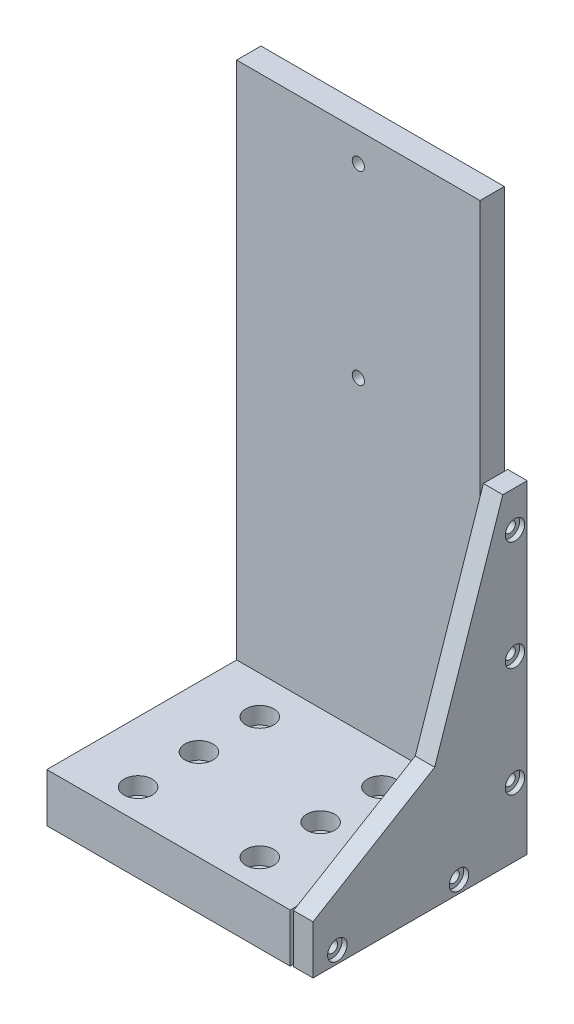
ISO-10303-21;
HEADER;
FILE_DESCRIPTION(('STEP AP214'),'2;1');
FILE_NAME('part.step','',(''),(''),'','','');
FILE_SCHEMA(('AUTOMOTIVE_DESIGN { 1 0 10303 214 1 1 1 1 }'));
ENDSEC;
DATA;
#1=APPLICATION_CONTEXT('core data for automotive mechanical design processes');
#2=APPLICATION_PROTOCOL_DEFINITION('international standard','automotive_design',2000,#1);
#3=PRODUCT_CONTEXT('',#1,'mechanical');
#4=PRODUCT('Part','Part','',(#3));
#5=PRODUCT_RELATED_PRODUCT_CATEGORY('part','',(#4));
#6=PRODUCT_DEFINITION_FORMATION('','',#4);
#7=PRODUCT_DEFINITION_CONTEXT('part definition',#1,'design');
#8=PRODUCT_DEFINITION('design','',#6,#7);
#9=PRODUCT_DEFINITION_SHAPE('','',#8);
#10=(LENGTH_UNIT() NAMED_UNIT(*) SI_UNIT(.MILLI.,.METRE.));
#11=(NAMED_UNIT(*) PLANE_ANGLE_UNIT() SI_UNIT($,.RADIAN.));
#12=(NAMED_UNIT(*) SI_UNIT($,.STERADIAN.) SOLID_ANGLE_UNIT());
#13=UNCERTAINTY_MEASURE_WITH_UNIT(LENGTH_MEASURE(1.E-05),#10,'distance_accuracy_value','');
#14=(GEOMETRIC_REPRESENTATION_CONTEXT(3) GLOBAL_UNCERTAINTY_ASSIGNED_CONTEXT((#13)) GLOBAL_UNIT_ASSIGNED_CONTEXT((#10,
#11,#12)) REPRESENTATION_CONTEXT('',''));
#15=CARTESIAN_POINT('',(0.,0.,0.));
#16=DIRECTION('',(0.,0.,1.));
#17=DIRECTION('',(1.,0.,0.));
#18=AXIS2_PLACEMENT_3D('',#15,#16,#17);
#19=CARTESIAN_POINT('',(52.7910147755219,6.72899010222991,28.9999999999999));
#20=DIRECTION('',(-1.,0.,0.));
#21=DIRECTION('',(0.,1.,0.));
#22=AXIS2_PLACEMENT_3D('',#19,#20,#21);
#23=PLANE('',#22);
#24=CARTESIAN_POINT('',(52.7910147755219,6.72899010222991,28.9999999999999));
#25=DIRECTION('',(-1.,0.,0.));
#26=DIRECTION('',(0.,-1.,0.));
#27=AXIS2_PLACEMENT_3D('',#24,#25,#26);
#28=CIRCLE('',#27,2.25000000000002);
#29=CARTESIAN_POINT('',(52.791014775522,4.47899010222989,28.9999999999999));
#30=VERTEX_POINT('',#29);
#31=EDGE_CURVE('P0_E203',#30,#30,#28,.T.);
#32=ORIENTED_EDGE('',*,*,#31,.F.);
#33=EDGE_LOOP('',(#32));
#34=FACE_BOUND('',#33,.T.);
#35=CARTESIAN_POINT('',(52.7910147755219,6.72899010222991,28.9999999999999));
#36=DIRECTION('',(1.,0.,0.));
#37=DIRECTION('',(0.,1.,0.));
#38=AXIS2_PLACEMENT_3D('',#35,#36,#37);
#39=CIRCLE('',#38,4.00000000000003);
#40=CARTESIAN_POINT('',(52.7910147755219,10.7289901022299,28.9999999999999));
#41=VERTEX_POINT('',#40);
#42=EDGE_CURVE('P0_E192',#41,#41,#39,.T.);
#43=ORIENTED_EDGE('',*,*,#42,.F.);
#44=EDGE_LOOP('',(#43));
#45=FACE_BOUND('',#44,.T.);
#46=ADVANCED_FACE('P0_F38',(#34,#45),#23,.T.);
#47=CARTESIAN_POINT('',(52.7910147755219,6.72899010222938,-21.0000000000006));
#48=DIRECTION('',(-1.,0.,0.));
#49=DIRECTION('',(0.,1.,0.));
#50=AXIS2_PLACEMENT_3D('',#47,#48,#49);
#51=PLANE('',#50);
#52=CARTESIAN_POINT('',(52.7910147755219,6.72899010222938,-21.0000000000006));
#53=DIRECTION('',(-1.,0.,0.));
#54=DIRECTION('',(0.,-1.,0.));
#55=AXIS2_PLACEMENT_3D('',#52,#53,#54);
#56=CIRCLE('',#55,2.25000000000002);
#57=CARTESIAN_POINT('',(52.791014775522,4.47899010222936,-21.0000000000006));
#58=VERTEX_POINT('',#57);
#59=EDGE_CURVE('P0_E41',#58,#58,#56,.T.);
#60=ORIENTED_EDGE('',*,*,#59,.F.);
#61=EDGE_LOOP('',(#60));
#62=FACE_BOUND('',#61,.T.);
#63=CARTESIAN_POINT('',(52.7910147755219,6.72899010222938,-21.0000000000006));
#64=DIRECTION('',(1.,0.,0.));
#65=DIRECTION('',(0.,1.,0.));
#66=AXIS2_PLACEMENT_3D('',#63,#64,#65);
#67=CIRCLE('',#66,4.00000000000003);
#68=CARTESIAN_POINT('',(52.7910147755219,10.7289901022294,-21.0000000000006));
#69=VERTEX_POINT('',#68);
#70=EDGE_CURVE('P0_E189',#69,#69,#67,.T.);
#71=ORIENTED_EDGE('',*,*,#70,.F.);
#72=EDGE_LOOP('',(#71));
#73=FACE_BOUND('',#72,.T.);
#74=ADVANCED_FACE('P0_F213',(#62,#73),#51,.T.);
#75=CARTESIAN_POINT('',(52.7910147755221,29.7289901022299,-44.0000000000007));
#76=DIRECTION('',(-1.,0.,0.));
#77=DIRECTION('',(0.,1.,0.));
#78=AXIS2_PLACEMENT_3D('',#75,#76,#77);
#79=PLANE('',#78);
#80=CARTESIAN_POINT('',(52.7910147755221,29.7289901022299,-44.0000000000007));
#81=DIRECTION('',(-1.,0.,0.));
#82=DIRECTION('',(0.,-1.,0.));
#83=AXIS2_PLACEMENT_3D('',#80,#81,#82);
#84=CIRCLE('',#83,2.25000000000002);
#85=CARTESIAN_POINT('',(52.7910147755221,27.4789901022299,-44.0000000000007));
#86=VERTEX_POINT('',#85);
#87=EDGE_CURVE('P0_E201',#86,#86,#84,.T.);
#88=ORIENTED_EDGE('',*,*,#87,.F.);
#89=EDGE_LOOP('',(#88));
#90=FACE_BOUND('',#89,.T.);
#91=CARTESIAN_POINT('',(52.7910147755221,29.7289901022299,-44.0000000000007));
#92=DIRECTION('',(1.,0.,0.));
#93=DIRECTION('',(0.,1.,0.));
#94=AXIS2_PLACEMENT_3D('',#91,#92,#93);
#95=CIRCLE('',#94,4.00000000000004);
#96=CARTESIAN_POINT('',(52.7910147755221,33.72899010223,-44.0000000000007));
#97=VERTEX_POINT('',#96);
#98=EDGE_CURVE('P0_E186',#97,#97,#95,.T.);
#99=ORIENTED_EDGE('',*,*,#98,.F.);
#100=EDGE_LOOP('',(#99));
#101=FACE_BOUND('',#100,.T.);
#102=ADVANCED_FACE('P0_F216',(#90,#101),#79,.T.);
#103=CARTESIAN_POINT('',(52.7910147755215,74.7289901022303,-44.0000000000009));
#104=DIRECTION('',(-1.,0.,0.));
#105=DIRECTION('',(0.,1.,0.));
#106=AXIS2_PLACEMENT_3D('',#103,#104,#105);
#107=PLANE('',#106);
#108=CARTESIAN_POINT('',(52.7910147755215,74.7289901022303,-44.0000000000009));
#109=DIRECTION('',(-1.,0.,0.));
#110=DIRECTION('',(0.,-1.,0.));
#111=AXIS2_PLACEMENT_3D('',#108,#109,#110);
#112=CIRCLE('',#111,2.25000000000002);
#113=CARTESIAN_POINT('',(52.7910147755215,72.4789901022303,-44.0000000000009));
#114=VERTEX_POINT('',#113);
#115=EDGE_CURVE('P0_E195',#114,#114,#112,.T.);
#116=ORIENTED_EDGE('',*,*,#115,.F.);
#117=EDGE_LOOP('',(#116));
#118=FACE_BOUND('',#117,.T.);
#119=CARTESIAN_POINT('',(52.7910147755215,74.7289901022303,-44.0000000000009));
#120=DIRECTION('',(1.,0.,0.));
#121=DIRECTION('',(0.,1.,0.));
#122=AXIS2_PLACEMENT_3D('',#119,#120,#121);
#123=CIRCLE('',#122,4.00000000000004);
#124=CARTESIAN_POINT('',(52.7910147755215,78.7289901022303,-44.0000000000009));
#125=VERTEX_POINT('',#124);
#126=EDGE_CURVE('P0_E183',#125,#125,#123,.T.);
#127=ORIENTED_EDGE('',*,*,#126,.F.);
#128=EDGE_LOOP('',(#127));
#129=FACE_BOUND('',#128,.T.);
#130=ADVANCED_FACE('P0_F252',(#118,#129),#107,.T.);
#131=CARTESIAN_POINT('',(52.7910147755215,119.728990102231,-44.0000000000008));
#132=DIRECTION('',(-1.,0.,0.));
#133=DIRECTION('',(0.,1.,0.));
#134=AXIS2_PLACEMENT_3D('',#131,#132,#133);
#135=PLANE('',#134);
#136=CARTESIAN_POINT('',(52.7910147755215,119.728990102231,-44.0000000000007));
#137=DIRECTION('',(-1.,0.,0.));
#138=DIRECTION('',(0.,-1.,0.));
#139=AXIS2_PLACEMENT_3D('',#136,#137,#138);
#140=CIRCLE('',#139,2.25000000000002);
#141=CARTESIAN_POINT('',(52.7910147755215,117.478990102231,-44.0000000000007));
#142=VERTEX_POINT('',#141);
#143=EDGE_CURVE('P0_E198',#142,#142,#140,.T.);
#144=ORIENTED_EDGE('',*,*,#143,.F.);
#145=EDGE_LOOP('',(#144));
#146=FACE_BOUND('',#145,.T.);
#147=CARTESIAN_POINT('',(52.7910147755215,119.728990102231,-44.0000000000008));
#148=DIRECTION('',(1.,0.,0.));
#149=DIRECTION('',(0.,1.,0.));
#150=AXIS2_PLACEMENT_3D('',#147,#148,#149);
#151=CIRCLE('',#150,4.00000000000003);
#152=CARTESIAN_POINT('',(52.7910147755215,123.728990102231,-44.0000000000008));
#153=VERTEX_POINT('',#152);
#154=EDGE_CURVE('P0_E180',#153,#153,#151,.T.);
#155=ORIENTED_EDGE('',*,*,#154,.F.);
#156=EDGE_LOOP('',(#155));
#157=FACE_BOUND('',#156,.T.);
#158=ADVANCED_FACE('P0_F260',(#146,#157),#135,.T.);
#159=CARTESIAN_POINT('',(58.6910147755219,6.72899010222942,-21.0000000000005));
#160=DIRECTION('',(1.,0.,0.));
#161=DIRECTION('',(0.,-1.,0.));
#162=AXIS2_PLACEMENT_3D('',#159,#160,#161);
#163=CYLINDRICAL_SURFACE('',#162,2.25000000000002);
#164=ORIENTED_EDGE('',*,*,#59,.T.);
#165=EDGE_LOOP('',(#164));
#166=FACE_BOUND('',#165,.T.);
#167=CARTESIAN_POINT('',(56.5910147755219,6.72899010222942,-21.0000000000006));
#168=DIRECTION('',(-1.,0.,0.));
#169=DIRECTION('',(0.,-1.,0.));
#170=AXIS2_PLACEMENT_3D('',#167,#168,#169);
#171=CIRCLE('',#170,2.25000000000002);
#172=CARTESIAN_POINT('',(56.5910147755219,4.4789901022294,-21.0000000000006));
#173=VERTEX_POINT('',#172);
#174=EDGE_CURVE('P0_E177',#173,#173,#171,.T.);
#175=ORIENTED_EDGE('',*,*,#174,.F.);
#176=EDGE_LOOP('',(#175));
#177=FACE_BOUND('',#176,.T.);
#178=ADVANCED_FACE('P0_F210',(#166,#177),#163,.F.);
#179=CARTESIAN_POINT('',(58.691014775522,6.72899010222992,28.9999999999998));
#180=DIRECTION('',(1.,0.,0.));
#181=DIRECTION('',(0.,-1.,0.));
#182=AXIS2_PLACEMENT_3D('',#179,#180,#181);
#183=CYLINDRICAL_SURFACE('',#182,2.25000000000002);
#184=ORIENTED_EDGE('',*,*,#31,.T.);
#185=EDGE_LOOP('',(#184));
#186=FACE_BOUND('',#185,.T.);
#187=CARTESIAN_POINT('',(56.591014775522,6.72899010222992,28.9999999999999));
#188=DIRECTION('',(-1.,0.,0.));
#189=DIRECTION('',(0.,-1.,0.));
#190=AXIS2_PLACEMENT_3D('',#187,#188,#189);
#191=CIRCLE('',#190,2.25000000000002);
#192=CARTESIAN_POINT('',(56.591014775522,4.4789901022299,28.9999999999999));
#193=VERTEX_POINT('',#192);
#194=EDGE_CURVE('P0_E174',#193,#193,#191,.T.);
#195=ORIENTED_EDGE('',*,*,#194,.F.);
#196=EDGE_LOOP('',(#195));
#197=FACE_BOUND('',#196,.T.);
#198=ADVANCED_FACE('P0_F275',(#186,#197),#183,.F.);
#199=CARTESIAN_POINT('',(58.6910147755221,29.7289901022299,-44.0000000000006));
#200=DIRECTION('',(1.,0.,0.));
#201=DIRECTION('',(0.,-1.,0.));
#202=AXIS2_PLACEMENT_3D('',#199,#200,#201);
#203=CYLINDRICAL_SURFACE('',#202,2.25000000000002);
#204=ORIENTED_EDGE('',*,*,#87,.T.);
#205=EDGE_LOOP('',(#204));
#206=FACE_BOUND('',#205,.T.);
#207=CARTESIAN_POINT('',(56.5910147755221,29.7289901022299,-44.0000000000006));
#208=DIRECTION('',(-1.,0.,0.));
#209=DIRECTION('',(0.,-1.,0.));
#210=AXIS2_PLACEMENT_3D('',#207,#208,#209);
#211=CIRCLE('',#210,2.25000000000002);
#212=CARTESIAN_POINT('',(56.5910147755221,27.4789901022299,-44.0000000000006));
#213=VERTEX_POINT('',#212);
#214=EDGE_CURVE('P0_E171',#213,#213,#211,.T.);
#215=ORIENTED_EDGE('',*,*,#214,.F.);
#216=EDGE_LOOP('',(#215));
#217=FACE_BOUND('',#216,.T.);
#218=ADVANCED_FACE('P0_F282',(#206,#217),#203,.F.);
#219=CARTESIAN_POINT('',(58.6910147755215,119.728990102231,-44.0000000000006));
#220=DIRECTION('',(1.,0.,0.));
#221=DIRECTION('',(0.,-1.,0.));
#222=AXIS2_PLACEMENT_3D('',#219,#220,#221);
#223=CYLINDRICAL_SURFACE('',#222,2.25000000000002);
#224=ORIENTED_EDGE('',*,*,#143,.T.);
#225=EDGE_LOOP('',(#224));
#226=FACE_BOUND('',#225,.T.);
#227=CARTESIAN_POINT('',(56.5910147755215,119.728990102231,-44.0000000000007));
#228=DIRECTION('',(-1.,0.,0.));
#229=DIRECTION('',(0.,-1.,0.));
#230=AXIS2_PLACEMENT_3D('',#227,#228,#229);
#231=CIRCLE('',#230,2.25000000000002);
#232=CARTESIAN_POINT('',(56.5910147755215,117.478990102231,-44.0000000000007));
#233=VERTEX_POINT('',#232);
#234=EDGE_CURVE('P0_E168',#233,#233,#231,.T.);
#235=ORIENTED_EDGE('',*,*,#234,.F.);
#236=EDGE_LOOP('',(#235));
#237=FACE_BOUND('',#236,.T.);
#238=ADVANCED_FACE('P0_F289',(#226,#237),#223,.F.);
#239=CARTESIAN_POINT('',(58.6910147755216,74.7289901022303,-44.0000000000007));
#240=DIRECTION('',(1.,0.,0.));
#241=DIRECTION('',(0.,-1.,0.));
#242=AXIS2_PLACEMENT_3D('',#239,#240,#241);
#243=CYLINDRICAL_SURFACE('',#242,2.25000000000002);
#244=ORIENTED_EDGE('',*,*,#115,.T.);
#245=EDGE_LOOP('',(#244));
#246=FACE_BOUND('',#245,.T.);
#247=CARTESIAN_POINT('',(56.5910147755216,74.7289901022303,-44.0000000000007));
#248=DIRECTION('',(-1.,0.,0.));
#249=DIRECTION('',(0.,-1.,0.));
#250=AXIS2_PLACEMENT_3D('',#247,#248,#249);
#251=CIRCLE('',#250,2.25000000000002);
#252=CARTESIAN_POINT('',(56.5910147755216,72.4789901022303,-44.0000000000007));
#253=VERTEX_POINT('',#252);
#254=EDGE_CURVE('P0_E165',#253,#253,#251,.T.);
#255=ORIENTED_EDGE('',*,*,#254,.F.);
#256=EDGE_LOOP('',(#255));
#257=FACE_BOUND('',#256,.T.);
#258=ADVANCED_FACE('P0_F232',(#246,#257),#243,.F.);
#259=CARTESIAN_POINT('',(52.7910147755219,6.72899010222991,28.9999999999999));
#260=DIRECTION('',(-1.,0.,0.));
#261=DIRECTION('',(0.,1.,0.));
#262=AXIS2_PLACEMENT_3D('',#259,#260,#261);
#263=CYLINDRICAL_SURFACE('',#262,4.00000000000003);
#264=CARTESIAN_POINT('',(50.691014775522,6.72899010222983,28.9999999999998));
#265=DIRECTION('',(1.,0.,0.));
#266=DIRECTION('',(0.,1.,0.));
#267=AXIS2_PLACEMENT_3D('',#264,#265,#266);
#268=CIRCLE('',#267,4.00000000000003);
#269=CARTESIAN_POINT('',(50.691014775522,10.7289901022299,28.9999999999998));
#270=VERTEX_POINT('',#269);
#271=EDGE_CURVE('P0_E162',#270,#270,#268,.F.);
#272=ORIENTED_EDGE('',*,*,#271,.T.);
#273=EDGE_LOOP('',(#272));
#274=FACE_BOUND('',#273,.T.);
#275=ORIENTED_EDGE('',*,*,#42,.T.);
#276=EDGE_LOOP('',(#275));
#277=FACE_BOUND('',#276,.T.);
#278=ADVANCED_FACE('P0_F222',(#274,#277),#263,.F.);
#279=CARTESIAN_POINT('',(52.7910147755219,6.72899010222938,-21.0000000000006));
#280=DIRECTION('',(-1.,0.,0.));
#281=DIRECTION('',(0.,1.,0.));
#282=AXIS2_PLACEMENT_3D('',#279,#280,#281);
#283=CYLINDRICAL_SURFACE('',#282,4.00000000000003);
#284=CARTESIAN_POINT('',(50.6910147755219,6.7289901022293,-21.0000000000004));
#285=DIRECTION('',(1.,0.,0.));
#286=DIRECTION('',(0.,1.,0.));
#287=AXIS2_PLACEMENT_3D('',#284,#285,#286);
#288=CIRCLE('',#287,4.00000000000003);
#289=CARTESIAN_POINT('',(50.6910147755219,10.7289901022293,-21.0000000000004));
#290=VERTEX_POINT('',#289);
#291=EDGE_CURVE('P0_E159',#290,#290,#288,.F.);
#292=ORIENTED_EDGE('',*,*,#291,.T.);
#293=EDGE_LOOP('',(#292));
#294=FACE_BOUND('',#293,.T.);
#295=ORIENTED_EDGE('',*,*,#70,.T.);
#296=EDGE_LOOP('',(#295));
#297=FACE_BOUND('',#296,.T.);
#298=ADVANCED_FACE('P0_F219',(#294,#297),#283,.F.);
#299=CARTESIAN_POINT('',(52.7910147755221,29.7289901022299,-44.0000000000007));
#300=DIRECTION('',(-1.,0.,0.));
#301=DIRECTION('',(0.,1.,0.));
#302=AXIS2_PLACEMENT_3D('',#299,#300,#301);
#303=CYLINDRICAL_SURFACE('',#302,4.00000000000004);
#304=CARTESIAN_POINT('',(50.6910147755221,29.7289901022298,-44.0000000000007));
#305=DIRECTION('',(1.,0.,0.));
#306=DIRECTION('',(0.,1.,0.));
#307=AXIS2_PLACEMENT_3D('',#304,#305,#306);
#308=CIRCLE('',#307,4.00000000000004);
#309=CARTESIAN_POINT('',(50.6910147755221,33.7289901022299,-44.0000000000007));
#310=VERTEX_POINT('',#309);
#311=EDGE_CURVE('P0_E156',#310,#310,#308,.F.);
#312=ORIENTED_EDGE('',*,*,#311,.T.);
#313=EDGE_LOOP('',(#312));
#314=FACE_BOUND('',#313,.T.);
#315=ORIENTED_EDGE('',*,*,#98,.T.);
#316=EDGE_LOOP('',(#315));
#317=FACE_BOUND('',#316,.T.);
#318=ADVANCED_FACE('P0_F221',(#314,#317),#303,.F.);
#319=CARTESIAN_POINT('',(52.7910147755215,74.7289901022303,-44.0000000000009));
#320=DIRECTION('',(-1.,0.,0.));
#321=DIRECTION('',(0.,1.,0.));
#322=AXIS2_PLACEMENT_3D('',#319,#320,#321);
#323=CYLINDRICAL_SURFACE('',#322,4.00000000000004);
#324=CARTESIAN_POINT('',(50.6910147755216,74.7289901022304,-44.0000000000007));
#325=DIRECTION('',(1.,0.,0.));
#326=DIRECTION('',(0.,1.,0.));
#327=AXIS2_PLACEMENT_3D('',#324,#325,#326);
#328=CIRCLE('',#327,4.00000000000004);
#329=CARTESIAN_POINT('',(50.6910147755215,78.7289901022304,-44.0000000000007));
#330=VERTEX_POINT('',#329);
#331=EDGE_CURVE('P0_E153',#330,#330,#328,.F.);
#332=ORIENTED_EDGE('',*,*,#331,.T.);
#333=EDGE_LOOP('',(#332));
#334=FACE_BOUND('',#333,.T.);
#335=ORIENTED_EDGE('',*,*,#126,.T.);
#336=EDGE_LOOP('',(#335));
#337=FACE_BOUND('',#336,.T.);
#338=ADVANCED_FACE('P0_F229',(#334,#337),#323,.F.);
#339=CARTESIAN_POINT('',(52.7910147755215,119.728990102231,-44.0000000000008));
#340=DIRECTION('',(-1.,0.,0.));
#341=DIRECTION('',(0.,1.,0.));
#342=AXIS2_PLACEMENT_3D('',#339,#340,#341);
#343=CYLINDRICAL_SURFACE('',#342,4.00000000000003);
#344=CARTESIAN_POINT('',(50.6910147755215,119.728990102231,-44.0000000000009));
#345=DIRECTION('',(1.,0.,0.));
#346=DIRECTION('',(0.,1.,0.));
#347=AXIS2_PLACEMENT_3D('',#344,#345,#346);
#348=CIRCLE('',#347,4.00000000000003);
#349=CARTESIAN_POINT('',(50.6910147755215,123.728990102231,-44.0000000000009));
#350=VERTEX_POINT('',#349);
#351=EDGE_CURVE('P0_E150',#350,#350,#348,.F.);
#352=ORIENTED_EDGE('',*,*,#351,.T.);
#353=EDGE_LOOP('',(#352));
#354=FACE_BOUND('',#353,.T.);
#355=ORIENTED_EDGE('',*,*,#154,.T.);
#356=EDGE_LOOP('',(#355));
#357=FACE_BOUND('',#356,.T.);
#358=ADVANCED_FACE('P0_F328',(#354,#357),#343,.F.);
#359=CARTESIAN_POINT('',(56.5910147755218,4.47899010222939,-21.0000000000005));
#360=DIRECTION('',(-1.,0.,0.));
#361=DIRECTION('',(0.,1.,0.));
#362=AXIS2_PLACEMENT_3D('',#359,#360,#361);
#363=PLANE('',#362);
#364=CARTESIAN_POINT('',(56.5910147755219,6.72899010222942,-21.0000000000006));
#365=DIRECTION('',(-1.,0.,0.));
#366=DIRECTION('',(0.,-1.,0.));
#367=AXIS2_PLACEMENT_3D('',#364,#365,#366);
#368=CIRCLE('',#367,4.00000000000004);
#369=CARTESIAN_POINT('',(56.5910147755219,2.72899010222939,-21.0000000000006));
#370=VERTEX_POINT('',#369);
#371=EDGE_CURVE('P0_E147',#370,#370,#368,.T.);
#372=ORIENTED_EDGE('',*,*,#371,.F.);
#373=EDGE_LOOP('',(#372));
#374=FACE_BOUND('',#373,.T.);
#375=ORIENTED_EDGE('',*,*,#174,.T.);
#376=EDGE_LOOP('',(#375));
#377=FACE_BOUND('',#376,.T.);
#378=ADVANCED_FACE('P0_F338',(#374,#377),#363,.F.);
#379=CARTESIAN_POINT('',(56.5910147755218,4.47899010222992,28.9999999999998));
#380=DIRECTION('',(-1.,0.,0.));
#381=DIRECTION('',(0.,1.,0.));
#382=AXIS2_PLACEMENT_3D('',#379,#380,#381);
#383=PLANE('',#382);
#384=CARTESIAN_POINT('',(56.591014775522,6.72899010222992,28.9999999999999));
#385=DIRECTION('',(-1.,0.,0.));
#386=DIRECTION('',(0.,-1.,0.));
#387=AXIS2_PLACEMENT_3D('',#384,#385,#386);
#388=CIRCLE('',#387,4.00000000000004);
#389=CARTESIAN_POINT('',(56.591014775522,2.72899010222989,28.9999999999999));
#390=VERTEX_POINT('',#389);
#391=EDGE_CURVE('P0_E144',#390,#390,#388,.T.);
#392=ORIENTED_EDGE('',*,*,#391,.F.);
#393=EDGE_LOOP('',(#392));
#394=FACE_BOUND('',#393,.T.);
#395=ORIENTED_EDGE('',*,*,#194,.T.);
#396=EDGE_LOOP('',(#395));
#397=FACE_BOUND('',#396,.T.);
#398=ADVANCED_FACE('P0_F348',(#394,#397),#383,.F.);
#399=CARTESIAN_POINT('',(56.5910147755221,27.4789901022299,-44.0000000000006));
#400=DIRECTION('',(-1.,0.,0.));
#401=DIRECTION('',(0.,1.,0.));
#402=AXIS2_PLACEMENT_3D('',#399,#400,#401);
#403=PLANE('',#402);
#404=CARTESIAN_POINT('',(56.5910147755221,29.7289901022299,-44.0000000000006));
#405=DIRECTION('',(-1.,0.,0.));
#406=DIRECTION('',(0.,-1.,0.));
#407=AXIS2_PLACEMENT_3D('',#404,#405,#406);
#408=CIRCLE('',#407,4.00000000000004);
#409=CARTESIAN_POINT('',(56.5910147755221,25.7289901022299,-44.0000000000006));
#410=VERTEX_POINT('',#409);
#411=EDGE_CURVE('P0_E141',#410,#410,#408,.T.);
#412=ORIENTED_EDGE('',*,*,#411,.F.);
#413=EDGE_LOOP('',(#412));
#414=FACE_BOUND('',#413,.T.);
#415=ORIENTED_EDGE('',*,*,#214,.T.);
#416=EDGE_LOOP('',(#415));
#417=FACE_BOUND('',#416,.T.);
#418=ADVANCED_FACE('P0_F358',(#414,#417),#403,.F.);
#419=CARTESIAN_POINT('',(56.5910147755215,117.478990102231,-44.0000000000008));
#420=DIRECTION('',(-1.,0.,0.));
#421=DIRECTION('',(0.,1.,0.));
#422=AXIS2_PLACEMENT_3D('',#419,#420,#421);
#423=PLANE('',#422);
#424=CARTESIAN_POINT('',(56.5910147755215,119.728990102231,-44.0000000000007));
#425=DIRECTION('',(-1.,0.,0.));
#426=DIRECTION('',(0.,-1.,0.));
#427=AXIS2_PLACEMENT_3D('',#424,#425,#426);
#428=CIRCLE('',#427,4.00000000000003);
#429=CARTESIAN_POINT('',(56.5910147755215,115.728990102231,-44.0000000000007));
#430=VERTEX_POINT('',#429);
#431=EDGE_CURVE('P0_E138',#430,#430,#428,.T.);
#432=ORIENTED_EDGE('',*,*,#431,.F.);
#433=EDGE_LOOP('',(#432));
#434=FACE_BOUND('',#433,.T.);
#435=ORIENTED_EDGE('',*,*,#234,.T.);
#436=EDGE_LOOP('',(#435));
#437=FACE_BOUND('',#436,.T.);
#438=ADVANCED_FACE('P0_F368',(#434,#437),#423,.F.);
#439=CARTESIAN_POINT('',(56.5910147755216,72.4789901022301,-44.0000000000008));
#440=DIRECTION('',(-1.,0.,0.));
#441=DIRECTION('',(0.,1.,0.));
#442=AXIS2_PLACEMENT_3D('',#439,#440,#441);
#443=PLANE('',#442);
#444=CARTESIAN_POINT('',(56.5910147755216,74.7289901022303,-44.0000000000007));
#445=DIRECTION('',(-1.,0.,0.));
#446=DIRECTION('',(0.,-1.,0.));
#447=AXIS2_PLACEMENT_3D('',#444,#445,#446);
#448=CIRCLE('',#447,4.00000000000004);
#449=CARTESIAN_POINT('',(56.5910147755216,70.7289901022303,-44.0000000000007));
#450=VERTEX_POINT('',#449);
#451=EDGE_CURVE('P0_E109',#450,#450,#448,.T.);
#452=ORIENTED_EDGE('',*,*,#451,.F.);
#453=EDGE_LOOP('',(#452));
#454=FACE_BOUND('',#453,.T.);
#455=ORIENTED_EDGE('',*,*,#254,.T.);
#456=EDGE_LOOP('',(#455));
#457=FACE_BOUND('',#456,.T.);
#458=ADVANCED_FACE('P0_F378',(#454,#457),#443,.F.);
#459=CARTESIAN_POINT('',(50.6910147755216,134.728990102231,38.9999999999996));
#460=DIRECTION('',(-1.,0.,0.));
#461=DIRECTION('',(0.,1.,0.));
#462=AXIS2_PLACEMENT_3D('',#459,#460,#461);
#463=PLANE('',#462);
#464=DIRECTION('',(0.,0.,-1.));
#465=VECTOR('',#464,1.);
#466=CARTESIAN_POINT('',(50.6910147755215,134.728990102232,-49.0000000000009));
#467=LINE('',#466,#465);
#468=CARTESIAN_POINT('',(50.6910147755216,134.728990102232,-49.0000000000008));
#469=VERTEX_POINT('',#468);
#470=CARTESIAN_POINT('',(50.6910147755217,134.728990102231,-39.0000000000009));
#471=VERTEX_POINT('',#470);
#472=EDGE_CURVE('P0_E114',#469,#471,#467,.F.);
#473=ORIENTED_EDGE('',*,*,#472,.F.);
#474=DIRECTION('',(0.,-1.,0.));
#475=VECTOR('',#474,1.);
#476=CARTESIAN_POINT('',(50.6910147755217,134.728990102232,-49.0000000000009));
#477=LINE('',#476,#475);
#478=CARTESIAN_POINT('',(50.6910147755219,1.72899010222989,-49.0000000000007));
#479=VERTEX_POINT('',#478);
#480=EDGE_CURVE('P0_E94',#479,#469,#477,.F.);
#481=ORIENTED_EDGE('',*,*,#480,.F.);
#482=DIRECTION('',(0.,0.,1.));
#483=VECTOR('',#482,1.);
#484=CARTESIAN_POINT('',(50.6910147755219,1.72899010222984,-49.0000000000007));
#485=LINE('',#484,#483);
#486=CARTESIAN_POINT('',(50.691014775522,1.72899010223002,38.9999999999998));
#487=VERTEX_POINT('',#486);
#488=EDGE_CURVE('P0_E101',#487,#479,#485,.F.);
#489=ORIENTED_EDGE('',*,*,#488,.F.);
#490=DIRECTION('',(0.,1.,0.));
#491=VECTOR('',#490,1.);
#492=CARTESIAN_POINT('',(50.6910147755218,134.728990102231,38.9999999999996));
#493=LINE('',#492,#491);
#494=CARTESIAN_POINT('',(50.691014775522,21.7289901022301,38.9999999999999));
#495=VERTEX_POINT('',#494);
#496=EDGE_CURVE('P0_E135',#495,#487,#493,.F.);
#497=ORIENTED_EDGE('',*,*,#496,.F.);
#498=DIRECTION('',(0.,0.514495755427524,-0.857492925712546));
#499=VECTOR('',#498,1.);
#500=CARTESIAN_POINT('',(50.6910147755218,51.7289901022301,-11.0000000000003));
#501=LINE('',#500,#499);
#502=CARTESIAN_POINT('',(50.6910147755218,51.7289901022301,-11.0000000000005));
#503=VERTEX_POINT('',#502);
#504=EDGE_CURVE('P0_E626',#503,#495,#501,.F.);
#505=ORIENTED_EDGE('',*,*,#504,.F.);
#506=DIRECTION('',(0.,0.947535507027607,-0.319650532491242));
#507=VECTOR('',#506,1.);
#508=CARTESIAN_POINT('',(50.6910147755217,134.728990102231,-39.0000000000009));
#509=LINE('',#508,#507);
#510=EDGE_CURVE('P0_E635',#471,#503,#509,.F.);
#511=ORIENTED_EDGE('',*,*,#510,.F.);
#512=EDGE_LOOP('',(#473,#481,#489,#497,#505,#511));
#513=FACE_BOUND('',#512,.T.);
#514=ORIENTED_EDGE('',*,*,#351,.F.);
#515=EDGE_LOOP('',(#514));
#516=FACE_BOUND('',#515,.T.);
#517=ORIENTED_EDGE('',*,*,#331,.F.);
#518=EDGE_LOOP('',(#517));
#519=FACE_BOUND('',#518,.T.);
#520=ORIENTED_EDGE('',*,*,#311,.F.);
#521=EDGE_LOOP('',(#520));
#522=FACE_BOUND('',#521,.T.);
#523=ORIENTED_EDGE('',*,*,#291,.F.);
#524=EDGE_LOOP('',(#523));
#525=FACE_BOUND('',#524,.T.);
#526=ORIENTED_EDGE('',*,*,#271,.F.);
#527=EDGE_LOOP('',(#526));
#528=FACE_BOUND('',#527,.T.);
#529=ADVANCED_FACE('P0_F111',(#513,#516,#519,#522,#525,#528),#463,.T.);
#530=CARTESIAN_POINT('',(58.6910147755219,6.72899010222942,-21.0000000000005));
#531=DIRECTION('',(1.,0.,0.));
#532=DIRECTION('',(0.,-1.,0.));
#533=AXIS2_PLACEMENT_3D('',#530,#531,#532);
#534=CYLINDRICAL_SURFACE('',#533,4.00000000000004);
#535=ORIENTED_EDGE('',*,*,#371,.T.);
#536=EDGE_LOOP('',(#535));
#537=FACE_BOUND('',#536,.T.);
#538=CARTESIAN_POINT('',(58.6910147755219,6.72899010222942,-21.0000000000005));
#539=DIRECTION('',(-1.,0.,0.));
#540=DIRECTION('',(0.,-1.,0.));
#541=AXIS2_PLACEMENT_3D('',#538,#539,#540);
#542=CIRCLE('',#541,4.00000000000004);
#543=CARTESIAN_POINT('',(58.6910147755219,2.72899010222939,-21.0000000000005));
#544=VERTEX_POINT('',#543);
#545=EDGE_CURVE('P0_E132',#544,#544,#542,.T.);
#546=ORIENTED_EDGE('',*,*,#545,.F.);
#547=EDGE_LOOP('',(#546));
#548=FACE_BOUND('',#547,.T.);
#549=ADVANCED_FACE('P0_F397',(#537,#548),#534,.F.);
#550=CARTESIAN_POINT('',(58.691014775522,6.72899010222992,28.9999999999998));
#551=DIRECTION('',(1.,0.,0.));
#552=DIRECTION('',(0.,-1.,0.));
#553=AXIS2_PLACEMENT_3D('',#550,#551,#552);
#554=CYLINDRICAL_SURFACE('',#553,4.00000000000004);
#555=ORIENTED_EDGE('',*,*,#391,.T.);
#556=EDGE_LOOP('',(#555));
#557=FACE_BOUND('',#556,.T.);
#558=CARTESIAN_POINT('',(58.691014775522,6.72899010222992,28.9999999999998));
#559=DIRECTION('',(-1.,0.,0.));
#560=DIRECTION('',(0.,-1.,0.));
#561=AXIS2_PLACEMENT_3D('',#558,#559,#560);
#562=CIRCLE('',#561,4.00000000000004);
#563=CARTESIAN_POINT('',(58.691014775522,2.72899010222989,28.9999999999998));
#564=VERTEX_POINT('',#563);
#565=EDGE_CURVE('P0_E129',#564,#564,#562,.T.);
#566=ORIENTED_EDGE('',*,*,#565,.F.);
#567=EDGE_LOOP('',(#566));
#568=FACE_BOUND('',#567,.T.);
#569=ADVANCED_FACE('P0_F406',(#557,#568),#554,.F.);
#570=CARTESIAN_POINT('',(58.6910147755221,29.7289901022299,-44.0000000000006));
#571=DIRECTION('',(1.,0.,0.));
#572=DIRECTION('',(0.,-1.,0.));
#573=AXIS2_PLACEMENT_3D('',#570,#571,#572);
#574=CYLINDRICAL_SURFACE('',#573,4.00000000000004);
#575=ORIENTED_EDGE('',*,*,#411,.T.);
#576=EDGE_LOOP('',(#575));
#577=FACE_BOUND('',#576,.T.);
#578=CARTESIAN_POINT('',(58.6910147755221,29.7289901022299,-44.0000000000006));
#579=DIRECTION('',(-1.,0.,0.));
#580=DIRECTION('',(0.,-1.,0.));
#581=AXIS2_PLACEMENT_3D('',#578,#579,#580);
#582=CIRCLE('',#581,4.00000000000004);
#583=CARTESIAN_POINT('',(58.6910147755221,25.7289901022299,-44.0000000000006));
#584=VERTEX_POINT('',#583);
#585=EDGE_CURVE('P0_E126',#584,#584,#582,.T.);
#586=ORIENTED_EDGE('',*,*,#585,.F.);
#587=EDGE_LOOP('',(#586));
#588=FACE_BOUND('',#587,.T.);
#589=ADVANCED_FACE('P0_F416',(#577,#588),#574,.F.);
#590=CARTESIAN_POINT('',(58.6910147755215,119.728990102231,-44.0000000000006));
#591=DIRECTION('',(1.,0.,0.));
#592=DIRECTION('',(0.,-1.,0.));
#593=AXIS2_PLACEMENT_3D('',#590,#591,#592);
#594=CYLINDRICAL_SURFACE('',#593,4.00000000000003);
#595=ORIENTED_EDGE('',*,*,#431,.T.);
#596=EDGE_LOOP('',(#595));
#597=FACE_BOUND('',#596,.T.);
#598=CARTESIAN_POINT('',(58.6910147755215,119.728990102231,-44.0000000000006));
#599=DIRECTION('',(-1.,0.,0.));
#600=DIRECTION('',(0.,-1.,0.));
#601=AXIS2_PLACEMENT_3D('',#598,#599,#600);
#602=CIRCLE('',#601,4.00000000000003);
#603=CARTESIAN_POINT('',(58.6910147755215,115.728990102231,-44.0000000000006));
#604=VERTEX_POINT('',#603);
#605=EDGE_CURVE('P0_E123',#604,#604,#602,.T.);
#606=ORIENTED_EDGE('',*,*,#605,.F.);
#607=EDGE_LOOP('',(#606));
#608=FACE_BOUND('',#607,.T.);
#609=ADVANCED_FACE('P0_F426',(#597,#608),#594,.F.);
#610=CARTESIAN_POINT('',(58.6910147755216,74.7289901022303,-44.0000000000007));
#611=DIRECTION('',(1.,0.,0.));
#612=DIRECTION('',(0.,-1.,0.));
#613=AXIS2_PLACEMENT_3D('',#610,#611,#612);
#614=CYLINDRICAL_SURFACE('',#613,4.00000000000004);
#615=ORIENTED_EDGE('',*,*,#451,.T.);
#616=EDGE_LOOP('',(#615));
#617=FACE_BOUND('',#616,.T.);
#618=CARTESIAN_POINT('',(58.6910147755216,74.7289901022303,-44.0000000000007));
#619=DIRECTION('',(-1.,0.,0.));
#620=DIRECTION('',(0.,-1.,0.));
#621=AXIS2_PLACEMENT_3D('',#618,#619,#620);
#622=CIRCLE('',#621,4.00000000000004);
#623=CARTESIAN_POINT('',(58.6910147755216,70.7289901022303,-44.0000000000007));
#624=VERTEX_POINT('',#623);
#625=EDGE_CURVE('P0_E119',#624,#624,#622,.T.);
#626=ORIENTED_EDGE('',*,*,#625,.F.);
#627=EDGE_LOOP('',(#626));
#628=FACE_BOUND('',#627,.T.);
#629=ADVANCED_FACE('P0_F436',(#617,#628),#614,.F.);
#630=CARTESIAN_POINT('',(58.6910147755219,1.72899010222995,-49.0000000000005));
#631=DIRECTION('',(0.,1.,0.));
#632=DIRECTION('',(0.,0.,1.));
#633=AXIS2_PLACEMENT_3D('',#630,#631,#632);
#634=PLANE('',#633);
#635=DIRECTION('',(-1.,0.,0.));
#636=VECTOR('',#635,1.);
#637=CARTESIAN_POINT('',(58.6910147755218,1.72899010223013,38.9999999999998));
#638=LINE('',#637,#636);
#639=CARTESIAN_POINT('',(58.691014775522,1.72899010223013,38.9999999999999));
#640=VERTEX_POINT('',#639);
#641=EDGE_CURVE('P0_E105',#487,#640,#638,.F.);
#642=ORIENTED_EDGE('',*,*,#641,.F.);
#643=ORIENTED_EDGE('',*,*,#488,.T.);
#644=DIRECTION('',(-1.,0.,0.));
#645=VECTOR('',#644,1.);
#646=CARTESIAN_POINT('',(58.6910147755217,1.72899010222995,-49.0000000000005));
#647=LINE('',#646,#645);
#648=CARTESIAN_POINT('',(58.6910147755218,1.72899010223,-49.0000000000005));
#649=VERTEX_POINT('',#648);
#650=EDGE_CURVE('P0_E90',#649,#479,#647,.T.);
#651=ORIENTED_EDGE('',*,*,#650,.F.);
#652=DIRECTION('',(0.,0.,1.));
#653=VECTOR('',#652,1.);
#654=CARTESIAN_POINT('',(58.691014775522,1.72899010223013,38.9999999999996));
#655=LINE('',#654,#653);
#656=EDGE_CURVE('P0_E122',#640,#649,#655,.F.);
#657=ORIENTED_EDGE('',*,*,#656,.F.);
#658=EDGE_LOOP('',(#642,#643,#651,#657));
#659=FACE_BOUND('',#658,.T.);
#660=ADVANCED_FACE('P0_F104',(#659),#634,.F.);
#661=CARTESIAN_POINT('',(58.6910147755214,134.728990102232,-49.0000000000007));
#662=DIRECTION('',(0.,0.,1.));
#663=DIRECTION('',(0.,-1.,0.));
#664=AXIS2_PLACEMENT_3D('',#661,#662,#663);
#665=PLANE('',#664);
#666=ORIENTED_EDGE('',*,*,#650,.T.);
#667=ORIENTED_EDGE('',*,*,#480,.T.);
#668=DIRECTION('',(-1.,0.,0.));
#669=VECTOR('',#668,1.);
#670=CARTESIAN_POINT('',(58.6910147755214,134.728990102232,-49.0000000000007));
#671=LINE('',#670,#669);
#672=CARTESIAN_POINT('',(58.6910147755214,134.728990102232,-49.0000000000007));
#673=VERTEX_POINT('',#672);
#674=EDGE_CURVE('P0_E85',#673,#469,#671,.T.);
#675=ORIENTED_EDGE('',*,*,#674,.F.);
#676=DIRECTION('',(0.,1.,0.));
#677=VECTOR('',#676,1.);
#678=CARTESIAN_POINT('',(58.6910147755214,134.728990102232,-49.0000000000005));
#679=LINE('',#678,#677);
#680=EDGE_CURVE('P0_E97',#649,#673,#679,.T.);
#681=ORIENTED_EDGE('',*,*,#680,.F.);
#682=EDGE_LOOP('',(#666,#667,#675,#681));
#683=FACE_BOUND('',#682,.T.);
#684=ADVANCED_FACE('P0_F92',(#683),#665,.F.);
#685=CARTESIAN_POINT('',(58.6910147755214,134.728990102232,-49.0000000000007));
#686=DIRECTION('',(0.,-1.,0.));
#687=DIRECTION('',(0.,0.,-1.));
#688=AXIS2_PLACEMENT_3D('',#685,#686,#687);
#689=PLANE('',#688);
#690=DIRECTION('',(-1.,0.,0.));
#691=VECTOR('',#690,1.);
#692=CARTESIAN_POINT('',(50.6910147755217,134.728990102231,-39.0000000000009));
#693=LINE('',#692,#691);
#694=CARTESIAN_POINT('',(58.6910147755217,134.728990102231,-39.0000000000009));
#695=VERTEX_POINT('',#694);
#696=EDGE_CURVE('P0_E638',#695,#471,#693,.T.);
#697=ORIENTED_EDGE('',*,*,#696,.F.);
#698=DIRECTION('',(0.,0.,1.));
#699=VECTOR('',#698,1.);
#700=CARTESIAN_POINT('',(58.6910147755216,134.728990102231,38.9999999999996));
#701=LINE('',#700,#699);
#702=EDGE_CURVE('P0_E640',#673,#695,#701,.T.);
#703=ORIENTED_EDGE('',*,*,#702,.F.);
#704=ORIENTED_EDGE('',*,*,#674,.T.);
#705=ORIENTED_EDGE('',*,*,#472,.T.);
#706=EDGE_LOOP('',(#697,#703,#704,#705));
#707=FACE_BOUND('',#706,.T.);
#708=ADVANCED_FACE('P0_F463',(#707),#689,.F.);
#709=CARTESIAN_POINT('',(50.6910147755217,134.728990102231,-39.0000000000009));
#710=DIRECTION('',(0.,-0.319650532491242,-0.947535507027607));
#711=DIRECTION('',(0.,0.947535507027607,-0.319650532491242));
#712=AXIS2_PLACEMENT_3D('',#709,#710,#711);
#713=PLANE('',#712);
#714=DIRECTION('',(-1.,0.,0.));
#715=VECTOR('',#714,1.);
#716=CARTESIAN_POINT('',(50.6910147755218,51.7289901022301,-11.0000000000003));
#717=LINE('',#716,#715);
#718=CARTESIAN_POINT('',(58.6910147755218,51.7289901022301,-11.0000000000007));
#719=VERTEX_POINT('',#718);
#720=EDGE_CURVE('P0_E633',#719,#503,#717,.T.);
#721=ORIENTED_EDGE('',*,*,#720,.F.);
#722=DIRECTION('',(0.,-0.947535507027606,0.319650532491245));
#723=VECTOR('',#722,1.);
#724=CARTESIAN_POINT('',(58.6910147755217,134.728990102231,-39.0000000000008));
#725=LINE('',#724,#723);
#726=EDGE_CURVE('P0_E620',#695,#719,#725,.T.);
#727=ORIENTED_EDGE('',*,*,#726,.F.);
#728=ORIENTED_EDGE('',*,*,#696,.T.);
#729=ORIENTED_EDGE('',*,*,#510,.T.);
#730=EDGE_LOOP('',(#721,#727,#728,#729));
#731=FACE_BOUND('',#730,.T.);
#732=ADVANCED_FACE('P0_F472',(#731),#713,.F.);
#733=CARTESIAN_POINT('',(50.6910147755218,51.7289901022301,-11.0000000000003));
#734=DIRECTION('',(0.,-0.857492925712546,-0.514495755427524));
#735=DIRECTION('',(0.,0.514495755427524,-0.857492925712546));
#736=AXIS2_PLACEMENT_3D('',#733,#734,#735);
#737=PLANE('',#736);
#738=DIRECTION('',(-1.,0.,0.));
#739=VECTOR('',#738,1.);
#740=CARTESIAN_POINT('',(58.6910147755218,21.7289901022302,38.9999999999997));
#741=LINE('',#740,#739);
#742=CARTESIAN_POINT('',(58.691014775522,21.7289901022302,39.));
#743=VERTEX_POINT('',#742);
#744=EDGE_CURVE('P0_E624',#743,#495,#741,.T.);
#745=ORIENTED_EDGE('',*,*,#744,.F.);
#746=DIRECTION('',(0.,-0.514495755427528,0.857492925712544));
#747=VECTOR('',#746,1.);
#748=CARTESIAN_POINT('',(58.6910147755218,51.7289901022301,-11.0000000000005));
#749=LINE('',#748,#747);
#750=EDGE_CURVE('P0_E47',#719,#743,#749,.T.);
#751=ORIENTED_EDGE('',*,*,#750,.F.);
#752=ORIENTED_EDGE('',*,*,#720,.T.);
#753=ORIENTED_EDGE('',*,*,#504,.T.);
#754=EDGE_LOOP('',(#745,#751,#752,#753));
#755=FACE_BOUND('',#754,.T.);
#756=ADVANCED_FACE('P0_F481',(#755),#737,.F.);
#757=CARTESIAN_POINT('',(58.6910147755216,134.728990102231,38.9999999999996));
#758=DIRECTION('',(0.,0.,-1.));
#759=DIRECTION('',(0.,1.,0.));
#760=AXIS2_PLACEMENT_3D('',#757,#758,#759);
#761=PLANE('',#760);
#762=ORIENTED_EDGE('',*,*,#744,.T.);
#763=ORIENTED_EDGE('',*,*,#496,.T.);
#764=ORIENTED_EDGE('',*,*,#641,.T.);
#765=DIRECTION('',(0.,1.,0.));
#766=VECTOR('',#765,1.);
#767=CARTESIAN_POINT('',(58.6910147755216,134.728990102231,39.0000000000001));
#768=LINE('',#767,#766);
#769=EDGE_CURVE('P0_E11',#743,#640,#768,.F.);
#770=ORIENTED_EDGE('',*,*,#769,.F.);
#771=EDGE_LOOP('',(#762,#763,#764,#770));
#772=FACE_BOUND('',#771,.T.);
#773=ADVANCED_FACE('P0_F491',(#772),#761,.F.);
#774=CARTESIAN_POINT('',(58.6910147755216,134.728990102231,38.9999999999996));
#775=DIRECTION('',(-1.,0.,0.));
#776=DIRECTION('',(0.,1.,0.));
#777=AXIS2_PLACEMENT_3D('',#774,#775,#776);
#778=PLANE('',#777);
#779=ORIENTED_EDGE('',*,*,#750,.T.);
#780=ORIENTED_EDGE('',*,*,#769,.T.);
#781=ORIENTED_EDGE('',*,*,#656,.T.);
#782=ORIENTED_EDGE('',*,*,#680,.T.);
#783=ORIENTED_EDGE('',*,*,#702,.T.);
#784=ORIENTED_EDGE('',*,*,#726,.T.);
#785=EDGE_LOOP('',(#779,#780,#781,#782,#783,#784));
#786=FACE_BOUND('',#785,.T.);
#787=ORIENTED_EDGE('',*,*,#625,.T.);
#788=EDGE_LOOP('',(#787));
#789=FACE_BOUND('',#788,.T.);
#790=ORIENTED_EDGE('',*,*,#605,.T.);
#791=EDGE_LOOP('',(#790));
#792=FACE_BOUND('',#791,.T.);
#793=ORIENTED_EDGE('',*,*,#585,.T.);
#794=EDGE_LOOP('',(#793));
#795=FACE_BOUND('',#794,.T.);
#796=ORIENTED_EDGE('',*,*,#565,.T.);
#797=EDGE_LOOP('',(#796));
#798=FACE_BOUND('',#797,.T.);
#799=ORIENTED_EDGE('',*,*,#545,.T.);
#800=EDGE_LOOP('',(#799));
#801=FACE_BOUND('',#800,.T.);
#802=ADVANCED_FACE('P0_F501',(#786,#789,#792,#795,#798,#801),#778,.F.);
#803=CLOSED_SHELL('',(#46,#74,#102,#130,#158,#178,#198,#218,#238,#258,#278,#298,#318,#338,#358,
#378,#398,#418,#438,#458,#529,#549,#569,#589,#609,#629,#660,#684,#708,#732,#756,#773,#802));
#804=MANIFOLD_SOLID_BREP('P0_B2',#803);
#805=CARTESIAN_POINT('',(-40.6910147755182,119.72899010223,-44.0000000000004));
#806=DIRECTION('',(-1.,0.,0.));
#807=DIRECTION('',(0.,-1.,0.));
#808=AXIS2_PLACEMENT_3D('',#805,#806,#807);
#809=CONICAL_SURFACE('',#808,1.6500000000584,1.02974425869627);
#810=CARTESIAN_POINT('',(-39.6995947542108,119.72899010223,-44.0000000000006));
#811=VERTEX_POINT('',#810);
#812=VERTEX_LOOP('',#811);
#813=FACE_BOUND('',#812,.T.);
#814=CARTESIAN_POINT('',(-40.6910147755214,119.72899010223,-44.0000000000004));
#815=DIRECTION('',(-1.,0.,0.));
#816=DIRECTION('',(0.,-1.,0.));
#817=AXIS2_PLACEMENT_3D('',#814,#815,#816);
#818=CIRCLE('',#817,1.65);
#819=CARTESIAN_POINT('',(-40.6910147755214,118.07899010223,-44.0000000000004));
#820=VERTEX_POINT('',#819);
#821=EDGE_CURVE('P1_E69',#820,#820,#818,.T.);
#822=ORIENTED_EDGE('',*,*,#821,.T.);
#823=EDGE_LOOP('',(#822));
#824=FACE_BOUND('',#823,.T.);
#825=ADVANCED_FACE('P1_F16',(#813,#824),#809,.F.);
#826=CARTESIAN_POINT('',(-40.6910147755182,74.7289901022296,-44.0000000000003));
#827=DIRECTION('',(-1.,0.,0.));
#828=DIRECTION('',(0.,-1.,0.));
#829=AXIS2_PLACEMENT_3D('',#826,#827,#828);
#830=CONICAL_SURFACE('',#829,1.65000000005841,1.02974425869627);
#831=CARTESIAN_POINT('',(-39.6995947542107,74.7289901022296,-44.0000000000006));
#832=VERTEX_POINT('',#831);
#833=VERTEX_LOOP('',#832);
#834=FACE_BOUND('',#833,.T.);
#835=CARTESIAN_POINT('',(-40.6910147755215,74.7289901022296,-44.0000000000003));
#836=DIRECTION('',(-1.,0.,0.));
#837=DIRECTION('',(0.,-1.,0.));
#838=AXIS2_PLACEMENT_3D('',#835,#836,#837);
#839=CIRCLE('',#838,1.65);
#840=CARTESIAN_POINT('',(-40.6910147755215,73.0789901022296,-44.0000000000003));
#841=VERTEX_POINT('',#840);
#842=EDGE_CURVE('P1_E71',#841,#841,#839,.T.);
#843=ORIENTED_EDGE('',*,*,#842,.T.);
#844=EDGE_LOOP('',(#843));
#845=FACE_BOUND('',#844,.T.);
#846=ADVANCED_FACE('P1_F66',(#834,#845),#830,.F.);
#847=CARTESIAN_POINT('',(-40.6910147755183,29.7289901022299,-44.0000000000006));
#848=DIRECTION('',(-1.,0.,0.));
#849=DIRECTION('',(0.,-1.,0.));
#850=AXIS2_PLACEMENT_3D('',#847,#848,#849);
#851=CONICAL_SURFACE('',#850,1.65000000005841,1.02974425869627);
#852=CARTESIAN_POINT('',(-39.6995947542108,29.7289901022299,-44.0000000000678));
#853=VERTEX_POINT('',#852);
#854=VERTEX_LOOP('',#853);
#855=FACE_BOUND('',#854,.T.);
#856=CARTESIAN_POINT('',(-40.6910147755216,29.7289901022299,-44.0000000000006));
#857=DIRECTION('',(-1.,0.,0.));
#858=DIRECTION('',(0.,-1.,0.));
#859=AXIS2_PLACEMENT_3D('',#856,#857,#858);
#860=CIRCLE('',#859,1.65);
#861=CARTESIAN_POINT('',(-40.6910147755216,28.0789901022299,-44.0000000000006));
#862=VERTEX_POINT('',#861);
#863=EDGE_CURVE('P1_E74',#862,#862,#860,.T.);
#864=ORIENTED_EDGE('',*,*,#863,.T.);
#865=EDGE_LOOP('',(#864));
#866=FACE_BOUND('',#865,.T.);
#867=ADVANCED_FACE('P1_F379',(#855,#866),#851,.F.);
#868=CARTESIAN_POINT('',(-0.691014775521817,11.2289901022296,-49.0000000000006));
#869=DIRECTION('',(0.,0.,-1.));
#870=DIRECTION('',(0.,1.,0.));
#871=AXIS2_PLACEMENT_3D('',#868,#869,#870);
#872=CYLINDRICAL_SURFACE('',#871,5.75);
#873=CARTESIAN_POINT('',(-0.691014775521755,11.2289901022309,-43.0000000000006));
#874=DIRECTION('',(0.,0.,-1.));
#875=DIRECTION('',(0.,1.,0.));
#876=AXIS2_PLACEMENT_3D('',#873,#874,#875);
#877=CIRCLE('',#876,5.75);
#878=CARTESIAN_POINT('',(-0.691014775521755,16.9789901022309,-43.0000000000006));
#879=VERTEX_POINT('',#878);
#880=EDGE_CURVE('P1_E127',#879,#879,#877,.F.);
#881=ORIENTED_EDGE('',*,*,#880,.T.);
#882=EDGE_LOOP('',(#881));
#883=FACE_BOUND('',#882,.T.);
#884=CARTESIAN_POINT('',(-0.691014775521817,11.2289901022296,-49.0000000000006));
#885=DIRECTION('',(0.,0.,-1.));
#886=DIRECTION('',(0.,1.,0.));
#887=AXIS2_PLACEMENT_3D('',#884,#885,#886);
#888=CIRCLE('',#887,5.75);
#889=CARTESIAN_POINT('',(-0.691014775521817,16.9789901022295,-49.0000000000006));
#890=VERTEX_POINT('',#889);
#891=EDGE_CURVE('P1_E124',#890,#890,#888,.T.);
#892=ORIENTED_EDGE('',*,*,#891,.T.);
#893=EDGE_LOOP('',(#892));
#894=FACE_BOUND('',#893,.T.);
#895=ADVANCED_FACE('P1_F371',(#883,#894),#872,.F.);
#896=CARTESIAN_POINT('',(-38.6910147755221,11.2289901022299,-49.0000000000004));
#897=DIRECTION('',(0.,0.,-1.));
#898=DIRECTION('',(0.,1.,0.));
#899=AXIS2_PLACEMENT_3D('',#896,#897,#898);
#900=CYLINDRICAL_SURFACE('',#899,5.75000000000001);
#901=CARTESIAN_POINT('',(-38.6910147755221,11.2289901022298,-43.0000000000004));
#902=DIRECTION('',(0.,0.,-1.));
#903=DIRECTION('',(0.,1.,0.));
#904=AXIS2_PLACEMENT_3D('',#901,#902,#903);
#905=CIRCLE('',#904,5.75000000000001);
#906=CARTESIAN_POINT('',(-38.6910147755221,16.9789901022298,-43.0000000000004));
#907=VERTEX_POINT('',#906);
#908=EDGE_CURVE('P1_E129',#907,#907,#905,.F.);
#909=ORIENTED_EDGE('',*,*,#908,.T.);
#910=EDGE_LOOP('',(#909));
#911=FACE_BOUND('',#910,.T.);
#912=CARTESIAN_POINT('',(-38.6910147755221,11.2289901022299,-49.0000000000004));
#913=DIRECTION('',(0.,0.,-1.));
#914=DIRECTION('',(0.,1.,0.));
#915=AXIS2_PLACEMENT_3D('',#912,#913,#914);
#916=CIRCLE('',#915,5.75000000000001);
#917=CARTESIAN_POINT('',(-38.6910147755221,16.9789901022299,-49.0000000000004));
#918=VERTEX_POINT('',#917);
#919=EDGE_CURVE('P1_E121',#918,#918,#916,.T.);
#920=ORIENTED_EDGE('',*,*,#919,.T.);
#921=EDGE_LOOP('',(#920));
#922=FACE_BOUND('',#921,.T.);
#923=ADVANCED_FACE('P1_F201',(#911,#922),#900,.F.);
#924=CARTESIAN_POINT('',(37.308985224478,11.2289901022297,-49.0000000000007));
#925=DIRECTION('',(0.,0.,-1.));
#926=DIRECTION('',(0.,1.,0.));
#927=AXIS2_PLACEMENT_3D('',#924,#925,#926);
#928=CYLINDRICAL_SURFACE('',#927,5.75);
#929=CARTESIAN_POINT('',(37.3089852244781,11.2289901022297,-43.0000000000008));
#930=DIRECTION('',(0.,0.,-1.));
#931=DIRECTION('',(0.,1.,0.));
#932=AXIS2_PLACEMENT_3D('',#929,#930,#931);
#933=CIRCLE('',#932,5.75);
#934=CARTESIAN_POINT('',(37.3089852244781,16.9789901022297,-43.0000000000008));
#935=VERTEX_POINT('',#934);
#936=EDGE_CURVE('P1_E19',#935,#935,#933,.F.);
#937=ORIENTED_EDGE('',*,*,#936,.T.);
#938=EDGE_LOOP('',(#937));
#939=FACE_BOUND('',#938,.T.);
#940=CARTESIAN_POINT('',(37.308985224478,11.2289901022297,-49.0000000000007));
#941=DIRECTION('',(0.,0.,-1.));
#942=DIRECTION('',(0.,1.,0.));
#943=AXIS2_PLACEMENT_3D('',#940,#941,#942);
#944=CIRCLE('',#943,5.75);
#945=CARTESIAN_POINT('',(37.308985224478,16.9789901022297,-49.0000000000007));
#946=VERTEX_POINT('',#945);
#947=EDGE_CURVE('P1_E118',#946,#946,#944,.T.);
#948=ORIENTED_EDGE('',*,*,#947,.T.);
#949=EDGE_LOOP('',(#948));
#950=FACE_BOUND('',#949,.T.);
#951=ADVANCED_FACE('P1_F191',(#939,#950),#928,.F.);
#952=CARTESIAN_POINT('',(-50.6910147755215,119.72899010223,-44.0000000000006));
#953=DIRECTION('',(-1.,0.,0.));
#954=DIRECTION('',(0.,-1.,0.));
#955=AXIS2_PLACEMENT_3D('',#952,#953,#954);
#956=CYLINDRICAL_SURFACE('',#955,1.65);
#957=ORIENTED_EDGE('',*,*,#821,.F.);
#958=EDGE_LOOP('',(#957));
#959=FACE_BOUND('',#958,.T.);
#960=CARTESIAN_POINT('',(-50.6910147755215,119.72899010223,-44.0000000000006));
#961=DIRECTION('',(-1.,0.,0.));
#962=DIRECTION('',(0.,-1.,0.));
#963=AXIS2_PLACEMENT_3D('',#960,#961,#962);
#964=CIRCLE('',#963,1.65);
#965=CARTESIAN_POINT('',(-50.6910147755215,118.07899010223,-44.0000000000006));
#966=VERTEX_POINT('',#965);
#967=EDGE_CURVE('P1_E110',#966,#966,#964,.T.);
#968=ORIENTED_EDGE('',*,*,#967,.T.);
#969=EDGE_LOOP('',(#968));
#970=FACE_BOUND('',#969,.T.);
#971=ADVANCED_FACE('P1_F188',(#959,#970),#956,.F.);
#972=CARTESIAN_POINT('',(-50.6910147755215,74.7289901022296,-44.0000000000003));
#973=DIRECTION('',(-1.,0.,0.));
#974=DIRECTION('',(0.,-1.,0.));
#975=AXIS2_PLACEMENT_3D('',#972,#973,#974);
#976=CYLINDRICAL_SURFACE('',#975,1.65);
#977=ORIENTED_EDGE('',*,*,#842,.F.);
#978=EDGE_LOOP('',(#977));
#979=FACE_BOUND('',#978,.T.);
#980=CARTESIAN_POINT('',(-50.6910147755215,74.7289901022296,-44.0000000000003));
#981=DIRECTION('',(-1.,0.,0.));
#982=DIRECTION('',(0.,-1.,0.));
#983=AXIS2_PLACEMENT_3D('',#980,#981,#982);
#984=CIRCLE('',#983,1.65);
#985=CARTESIAN_POINT('',(-50.6910147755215,73.0789901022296,-44.0000000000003));
#986=VERTEX_POINT('',#985);
#987=EDGE_CURVE('P1_E107',#986,#986,#984,.T.);
#988=ORIENTED_EDGE('',*,*,#987,.T.);
#989=EDGE_LOOP('',(#988));
#990=FACE_BOUND('',#989,.T.);
#991=ADVANCED_FACE('P1_F190',(#979,#990),#976,.F.);
#992=CARTESIAN_POINT('',(-50.6910147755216,29.7289901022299,-44.0000000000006));
#993=DIRECTION('',(-1.,0.,0.));
#994=DIRECTION('',(0.,-1.,0.));
#995=AXIS2_PLACEMENT_3D('',#992,#993,#994);
#996=CYLINDRICAL_SURFACE('',#995,1.65);
#997=ORIENTED_EDGE('',*,*,#863,.F.);
#998=EDGE_LOOP('',(#997));
#999=FACE_BOUND('',#998,.T.);
#1000=CARTESIAN_POINT('',(-50.6910147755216,29.7289901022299,-44.0000000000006));
#1001=DIRECTION('',(-1.,0.,0.));
#1002=DIRECTION('',(0.,-1.,0.));
#1003=AXIS2_PLACEMENT_3D('',#1000,#1001,#1002);
#1004=CIRCLE('',#1003,1.65);
#1005=CARTESIAN_POINT('',(-50.6910147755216,28.0789901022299,-44.0000000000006));
#1006=VERTEX_POINT('',#1005);
#1007=EDGE_CURVE('P1_E103',#1006,#1006,#1004,.T.);
#1008=ORIENTED_EDGE('',*,*,#1007,.T.);
#1009=EDGE_LOOP('',(#1008));
#1010=FACE_BOUND('',#1009,.T.);
#1011=ADVANCED_FACE('P1_F198',(#999,#1010),#996,.F.);
#1012=CARTESIAN_POINT('',(33.5589852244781,11.2289901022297,-43.0000000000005));
#1013=DIRECTION('',(0.,0.,1.));
#1014=DIRECTION('',(0.,-1.,0.));
#1015=AXIS2_PLACEMENT_3D('',#1012,#1013,#1014);
#1016=PLANE('',#1015);
#1017=ORIENTED_EDGE('',*,*,#936,.F.);
#1018=EDGE_LOOP('',(#1017));
#1019=FACE_BOUND('',#1018,.T.);
#1020=CARTESIAN_POINT('',(37.3089852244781,11.2289901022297,-43.0000000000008));
#1021=DIRECTION('',(0.,0.,-1.));
#1022=DIRECTION('',(0.,1.,0.));
#1023=AXIS2_PLACEMENT_3D('',#1020,#1021,#1022);
#1024=CIRCLE('',#1023,3.75);
#1025=CARTESIAN_POINT('',(37.3089852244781,14.9789901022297,-43.0000000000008));
#1026=VERTEX_POINT('',#1025);
#1027=EDGE_CURVE('P1_E100',#1026,#1026,#1024,.F.);
#1028=ORIENTED_EDGE('',*,*,#1027,.T.);
#1029=EDGE_LOOP('',(#1028));
#1030=FACE_BOUND('',#1029,.T.);
#1031=ADVANCED_FACE('P1_F247',(#1019,#1030),#1016,.F.);
#1032=CARTESIAN_POINT('',(-42.4410147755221,11.2289901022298,-43.0000000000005));
#1033=DIRECTION('',(0.,0.,1.));
#1034=DIRECTION('',(0.,-1.,0.));
#1035=AXIS2_PLACEMENT_3D('',#1032,#1033,#1034);
#1036=PLANE('',#1035);
#1037=ORIENTED_EDGE('',*,*,#908,.F.);
#1038=EDGE_LOOP('',(#1037));
#1039=FACE_BOUND('',#1038,.T.);
#1040=CARTESIAN_POINT('',(-38.6910147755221,11.2289901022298,-43.0000000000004));
#1041=DIRECTION('',(0.,0.,-1.));
#1042=DIRECTION('',(0.,1.,0.));
#1043=AXIS2_PLACEMENT_3D('',#1040,#1041,#1042);
#1044=CIRCLE('',#1043,3.75);
#1045=CARTESIAN_POINT('',(-38.6910147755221,14.9789901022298,-43.0000000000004));
#1046=VERTEX_POINT('',#1045);
#1047=EDGE_CURVE('P1_E97',#1046,#1046,#1044,.F.);
#1048=ORIENTED_EDGE('',*,*,#1047,.T.);
#1049=EDGE_LOOP('',(#1048));
#1050=FACE_BOUND('',#1049,.T.);
#1051=ADVANCED_FACE('P1_F243',(#1039,#1050),#1036,.F.);
#1052=CARTESIAN_POINT('',(-4.44101477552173,11.2289901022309,-43.0000000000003));
#1053=DIRECTION('',(0.,0.,1.));
#1054=DIRECTION('',(0.,-1.,0.));
#1055=AXIS2_PLACEMENT_3D('',#1052,#1053,#1054);
#1056=PLANE('',#1055);
#1057=ORIENTED_EDGE('',*,*,#880,.F.);
#1058=EDGE_LOOP('',(#1057));
#1059=FACE_BOUND('',#1058,.T.);
#1060=CARTESIAN_POINT('',(-0.691014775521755,11.2289901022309,-43.0000000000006));
#1061=DIRECTION('',(0.,0.,-1.));
#1062=DIRECTION('',(0.,1.,0.));
#1063=AXIS2_PLACEMENT_3D('',#1060,#1061,#1062);
#1064=CIRCLE('',#1063,3.75);
#1065=CARTESIAN_POINT('',(-0.691014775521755,14.9789901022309,-43.0000000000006));
#1066=VERTEX_POINT('',#1065);
#1067=EDGE_CURVE('P1_E94',#1066,#1066,#1064,.F.);
#1068=ORIENTED_EDGE('',*,*,#1067,.T.);
#1069=EDGE_LOOP('',(#1068));
#1070=FACE_BOUND('',#1069,.T.);
#1071=ADVANCED_FACE('P1_F239',(#1059,#1070),#1056,.F.);
#1072=CARTESIAN_POINT('',(49.3089852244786,234.728990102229,-49.0000000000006));
#1073=DIRECTION('',(0.,0.,1.));
#1074=DIRECTION('',(0.,-1.,0.));
#1075=AXIS2_PLACEMENT_3D('',#1072,#1073,#1074);
#1076=PLANE('',#1075);
#1077=DIRECTION('',(-1.,0.,0.));
#1078=VECTOR('',#1077,1.);
#1079=CARTESIAN_POINT('',(49.3089852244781,1.22899010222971,-49.0000000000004));
#1080=LINE('',#1079,#1078);
#1081=CARTESIAN_POINT('',(49.3089852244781,1.22899010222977,-49.0000000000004));
#1082=VERTEX_POINT('',#1081);
#1083=CARTESIAN_POINT('',(-50.6910147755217,1.22899010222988,-49.0000000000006));
#1084=VERTEX_POINT('',#1083);
#1085=EDGE_CURVE('P1_E150',#1082,#1084,#1080,.T.);
#1086=ORIENTED_EDGE('',*,*,#1085,.T.);
#1087=DIRECTION('',(0.,1.,0.));
#1088=VECTOR('',#1087,1.);
#1089=CARTESIAN_POINT('',(-50.6910147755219,1.22899010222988,-49.0000000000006));
#1090=LINE('',#1089,#1088);
#1091=CARTESIAN_POINT('',(-50.6910147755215,234.728990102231,-49.0000000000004));
#1092=VERTEX_POINT('',#1091);
#1093=EDGE_CURVE('P1_E106',#1084,#1092,#1090,.T.);
#1094=ORIENTED_EDGE('',*,*,#1093,.T.);
#1095=DIRECTION('',(1.,0.,0.));
#1096=VECTOR('',#1095,1.);
#1097=CARTESIAN_POINT('',(49.3089852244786,234.728990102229,-49.0000000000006));
#1098=LINE('',#1097,#1096);
#1099=CARTESIAN_POINT('',(49.3089852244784,234.728990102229,-49.0000000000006));
#1100=VERTEX_POINT('',#1099);
#1101=EDGE_CURVE('P1_E141',#1092,#1100,#1098,.T.);
#1102=ORIENTED_EDGE('',*,*,#1101,.T.);
#1103=DIRECTION('',(0.,-1.,0.));
#1104=VECTOR('',#1103,1.);
#1105=CARTESIAN_POINT('',(49.3089852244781,1.22899010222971,-49.0000000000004));
#1106=LINE('',#1105,#1104);
#1107=EDGE_CURVE('P1_E117',#1100,#1082,#1106,.T.);
#1108=ORIENTED_EDGE('',*,*,#1107,.T.);
#1109=EDGE_LOOP('',(#1086,#1094,#1102,#1108));
#1110=FACE_BOUND('',#1109,.T.);
#1111=ORIENTED_EDGE('',*,*,#947,.F.);
#1112=EDGE_LOOP('',(#1111));
#1113=FACE_BOUND('',#1112,.T.);
#1114=ORIENTED_EDGE('',*,*,#919,.F.);
#1115=EDGE_LOOP('',(#1114));
#1116=FACE_BOUND('',#1115,.T.);
#1117=ORIENTED_EDGE('',*,*,#891,.F.);
#1118=EDGE_LOOP('',(#1117));
#1119=FACE_BOUND('',#1118,.T.);
#1120=CARTESIAN_POINT('',(-0.691014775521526,146.62899010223,-49.0000000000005));
#1121=DIRECTION('',(0.,0.,-1.));
#1122=DIRECTION('',(0.,1.,0.));
#1123=AXIS2_PLACEMENT_3D('',#1120,#1121,#1122);
#1124=CIRCLE('',#1123,2.49999999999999);
#1125=CARTESIAN_POINT('',(-0.691014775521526,149.12899010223,-49.0000000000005));
#1126=VERTEX_POINT('',#1125);
#1127=EDGE_CURVE('P1_E91',#1126,#1126,#1124,.F.);
#1128=ORIENTED_EDGE('',*,*,#1127,.T.);
#1129=EDGE_LOOP('',(#1128));
#1130=FACE_BOUND('',#1129,.T.);
#1131=CARTESIAN_POINT('',(-0.691014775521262,222.82899010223,-49.0000000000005));
#1132=DIRECTION('',(0.,0.,-1.));
#1133=DIRECTION('',(0.,1.,0.));
#1134=AXIS2_PLACEMENT_3D('',#1131,#1132,#1133);
#1135=CIRCLE('',#1134,2.49999999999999);
#1136=CARTESIAN_POINT('',(-0.691014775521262,225.32899010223,-49.0000000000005));
#1137=VERTEX_POINT('',#1136);
#1138=EDGE_CURVE('P1_E114',#1137,#1137,#1135,.F.);
#1139=ORIENTED_EDGE('',*,*,#1138,.T.);
#1140=EDGE_LOOP('',(#1139));
#1141=FACE_BOUND('',#1140,.T.);
#1142=ADVANCED_FACE('P1_F235',(#1110,#1113,#1116,#1119,#1130,#1141),#1076,.F.);
#1143=CARTESIAN_POINT('',(-0.691014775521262,222.82899010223,-49.0000000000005));
#1144=DIRECTION('',(0.,0.,-1.));
#1145=DIRECTION('',(0.,1.,0.));
#1146=AXIS2_PLACEMENT_3D('',#1143,#1144,#1145);
#1147=CYLINDRICAL_SURFACE('',#1146,2.49999999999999);
#1148=ORIENTED_EDGE('',*,*,#1138,.F.);
#1149=EDGE_LOOP('',(#1148));
#1150=FACE_BOUND('',#1149,.T.);
#1151=CARTESIAN_POINT('',(-0.691014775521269,222.82899010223,-39.0000000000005));
#1152=DIRECTION('',(0.,0.,-1.));
#1153=DIRECTION('',(0.,1.,0.));
#1154=AXIS2_PLACEMENT_3D('',#1151,#1152,#1153);
#1155=CIRCLE('',#1154,2.49999999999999);
#1156=CARTESIAN_POINT('',(-0.691014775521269,225.32899010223,-39.0000000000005));
#1157=VERTEX_POINT('',#1156);
#1158=EDGE_CURVE('P1_E87',#1157,#1157,#1155,.T.);
#1159=ORIENTED_EDGE('',*,*,#1158,.F.);
#1160=EDGE_LOOP('',(#1159));
#1161=FACE_BOUND('',#1160,.T.);
#1162=ADVANCED_FACE('P1_F232',(#1150,#1161),#1147,.F.);
#1163=CARTESIAN_POINT('',(49.3089852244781,1.22899010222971,-49.0000000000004));
#1164=DIRECTION('',(-1.,0.,0.));
#1165=DIRECTION('',(0.,-1.,0.));
#1166=AXIS2_PLACEMENT_3D('',#1163,#1164,#1165);
#1167=PLANE('',#1166);
#1168=DIRECTION('',(0.,0.,1.));
#1169=VECTOR('',#1168,1.);
#1170=CARTESIAN_POINT('',(49.3089852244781,1.22899010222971,-49.0000000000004));
#1171=LINE('',#1170,#1169);
#1172=CARTESIAN_POINT('',(49.3089852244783,1.22899010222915,-39.0000000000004));
#1173=VERTEX_POINT('',#1172);
#1174=EDGE_CURVE('P1_E147',#1173,#1082,#1171,.F.);
#1175=ORIENTED_EDGE('',*,*,#1174,.T.);
#1176=ORIENTED_EDGE('',*,*,#1107,.F.);
#1177=DIRECTION('',(0.,0.,1.));
#1178=VECTOR('',#1177,1.);
#1179=CARTESIAN_POINT('',(49.3089852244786,234.728990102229,-49.0000000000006));
#1180=LINE('',#1179,#1178);
#1181=CARTESIAN_POINT('',(49.3089852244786,234.728990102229,-39.0000000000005));
#1182=VERTEX_POINT('',#1181);
#1183=EDGE_CURVE('P1_E113',#1100,#1182,#1180,.T.);
#1184=ORIENTED_EDGE('',*,*,#1183,.T.);
#1185=DIRECTION('',(0.,-1.,0.));
#1186=VECTOR('',#1185,1.);
#1187=CARTESIAN_POINT('',(49.3089852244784,234.728990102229,-39.0000000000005));
#1188=LINE('',#1187,#1186);
#1189=EDGE_CURVE('P1_E90',#1173,#1182,#1188,.F.);
#1190=ORIENTED_EDGE('',*,*,#1189,.F.);
#1191=EDGE_LOOP('',(#1175,#1176,#1184,#1190));
#1192=FACE_BOUND('',#1191,.T.);
#1193=ADVANCED_FACE('P1_F171',(#1192),#1167,.F.);
#1194=CARTESIAN_POINT('',(49.3089852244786,234.728990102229,-49.0000000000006));
#1195=DIRECTION('',(0.,-1.,0.));
#1196=DIRECTION('',(1.,0.,0.));
#1197=AXIS2_PLACEMENT_3D('',#1194,#1195,#1196);
#1198=PLANE('',#1197);
#1199=ORIENTED_EDGE('',*,*,#1183,.F.);
#1200=ORIENTED_EDGE('',*,*,#1101,.F.);
#1201=DIRECTION('',(0.,0.,1.));
#1202=VECTOR('',#1201,1.);
#1203=CARTESIAN_POINT('',(-50.6910147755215,234.728990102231,-49.0000000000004));
#1204=LINE('',#1203,#1202);
#1205=CARTESIAN_POINT('',(-50.6910147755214,234.728990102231,-39.0000000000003));
#1206=VERTEX_POINT('',#1205);
#1207=EDGE_CURVE('P1_E145',#1092,#1206,#1204,.T.);
#1208=ORIENTED_EDGE('',*,*,#1207,.T.);
#1209=DIRECTION('',(1.,0.,0.));
#1210=VECTOR('',#1209,1.);
#1211=CARTESIAN_POINT('',(49.3089852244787,234.728990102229,-39.0000000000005));
#1212=LINE('',#1211,#1210);
#1213=EDGE_CURVE('P1_E155',#1182,#1206,#1212,.F.);
#1214=ORIENTED_EDGE('',*,*,#1213,.F.);
#1215=EDGE_LOOP('',(#1199,#1200,#1208,#1214));
#1216=FACE_BOUND('',#1215,.T.);
#1217=ADVANCED_FACE('P1_F176',(#1216),#1198,.F.);
#1218=CARTESIAN_POINT('',(-50.6910147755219,1.22899010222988,-49.0000000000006));
#1219=DIRECTION('',(1.,0.,0.));
#1220=DIRECTION('',(0.,1.,0.));
#1221=AXIS2_PLACEMENT_3D('',#1218,#1219,#1220);
#1222=PLANE('',#1221);
#1223=ORIENTED_EDGE('',*,*,#1207,.F.);
#1224=ORIENTED_EDGE('',*,*,#1093,.F.);
#1225=DIRECTION('',(0.,0.,1.));
#1226=VECTOR('',#1225,1.);
#1227=CARTESIAN_POINT('',(-50.6910147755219,1.22899010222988,-49.0000000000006));
#1228=LINE('',#1227,#1226);
#1229=CARTESIAN_POINT('',(-50.6910147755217,1.22899010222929,-39.0000000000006));
#1230=VERTEX_POINT('',#1229);
#1231=EDGE_CURVE('P1_E34',#1084,#1230,#1228,.T.);
#1232=ORIENTED_EDGE('',*,*,#1231,.T.);
#1233=DIRECTION('',(0.,-1.,0.));
#1234=VECTOR('',#1233,1.);
#1235=CARTESIAN_POINT('',(-50.6910147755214,234.72899010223,-39.0000000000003));
#1236=LINE('',#1235,#1234);
#1237=EDGE_CURVE('P1_E158',#1206,#1230,#1236,.T.);
#1238=ORIENTED_EDGE('',*,*,#1237,.F.);
#1239=EDGE_LOOP('',(#1223,#1224,#1232,#1238));
#1240=FACE_BOUND('',#1239,.T.);
#1241=ORIENTED_EDGE('',*,*,#1007,.F.);
#1242=EDGE_LOOP('',(#1241));
#1243=FACE_BOUND('',#1242,.T.);
#1244=ORIENTED_EDGE('',*,*,#987,.F.);
#1245=EDGE_LOOP('',(#1244));
#1246=FACE_BOUND('',#1245,.T.);
#1247=ORIENTED_EDGE('',*,*,#967,.F.);
#1248=EDGE_LOOP('',(#1247));
#1249=FACE_BOUND('',#1248,.T.);
#1250=ADVANCED_FACE('P1_F178',(#1240,#1243,#1246,#1249),#1222,.F.);
#1251=CARTESIAN_POINT('',(49.3089852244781,1.22899010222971,-49.0000000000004));
#1252=DIRECTION('',(0.,1.,0.));
#1253=DIRECTION('',(-1.,0.,0.));
#1254=AXIS2_PLACEMENT_3D('',#1251,#1252,#1253);
#1255=PLANE('',#1254);
#1256=ORIENTED_EDGE('',*,*,#1231,.F.);
#1257=ORIENTED_EDGE('',*,*,#1085,.F.);
#1258=ORIENTED_EDGE('',*,*,#1174,.F.);
#1259=DIRECTION('',(1.,0.,0.));
#1260=VECTOR('',#1259,1.);
#1261=CARTESIAN_POINT('',(49.3089852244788,1.22899010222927,-39.0000000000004));
#1262=LINE('',#1261,#1260);
#1263=EDGE_CURVE('P1_E86',#1230,#1173,#1262,.T.);
#1264=ORIENTED_EDGE('',*,*,#1263,.F.);
#1265=EDGE_LOOP('',(#1256,#1257,#1258,#1264));
#1266=FACE_BOUND('',#1265,.T.);
#1267=ADVANCED_FACE('P1_F167',(#1266),#1255,.F.);
#1268=CARTESIAN_POINT('',(37.308985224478,11.2289901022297,-49.0000000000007));
#1269=DIRECTION('',(0.,0.,-1.));
#1270=DIRECTION('',(0.,1.,0.));
#1271=AXIS2_PLACEMENT_3D('',#1268,#1269,#1270);
#1272=CYLINDRICAL_SURFACE('',#1271,3.75);
#1273=ORIENTED_EDGE('',*,*,#1027,.F.);
#1274=EDGE_LOOP('',(#1273));
#1275=FACE_BOUND('',#1274,.T.);
#1276=CARTESIAN_POINT('',(37.3089852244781,11.2289901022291,-39.0000000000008));
#1277=DIRECTION('',(0.,0.,-1.));
#1278=DIRECTION('',(0.,1.,0.));
#1279=AXIS2_PLACEMENT_3D('',#1276,#1277,#1278);
#1280=CIRCLE('',#1279,3.75);
#1281=CARTESIAN_POINT('',(37.3089852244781,14.9789901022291,-39.0000000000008));
#1282=VERTEX_POINT('',#1281);
#1283=EDGE_CURVE('P1_E83',#1282,#1282,#1280,.T.);
#1284=ORIENTED_EDGE('',*,*,#1283,.F.);
#1285=EDGE_LOOP('',(#1284));
#1286=FACE_BOUND('',#1285,.T.);
#1287=ADVANCED_FACE('P1_F221',(#1275,#1286),#1272,.F.);
#1288=CARTESIAN_POINT('',(-38.6910147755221,11.2289901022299,-49.0000000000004));
#1289=DIRECTION('',(0.,0.,-1.));
#1290=DIRECTION('',(0.,1.,0.));
#1291=AXIS2_PLACEMENT_3D('',#1288,#1289,#1290);
#1292=CYLINDRICAL_SURFACE('',#1291,3.75);
#1293=ORIENTED_EDGE('',*,*,#1047,.F.);
#1294=EDGE_LOOP('',(#1293));
#1295=FACE_BOUND('',#1294,.T.);
#1296=CARTESIAN_POINT('',(-38.691014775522,11.2289901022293,-39.0000000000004));
#1297=DIRECTION('',(0.,0.,-1.));
#1298=DIRECTION('',(0.,1.,0.));
#1299=AXIS2_PLACEMENT_3D('',#1296,#1297,#1298);
#1300=CIRCLE('',#1299,3.75);
#1301=CARTESIAN_POINT('',(-38.691014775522,14.9789901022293,-39.0000000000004));
#1302=VERTEX_POINT('',#1301);
#1303=EDGE_CURVE('P1_E80',#1302,#1302,#1300,.T.);
#1304=ORIENTED_EDGE('',*,*,#1303,.F.);
#1305=EDGE_LOOP('',(#1304));
#1306=FACE_BOUND('',#1305,.T.);
#1307=ADVANCED_FACE('P1_F217',(#1295,#1306),#1292,.F.);
#1308=CARTESIAN_POINT('',(-0.691014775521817,11.2289901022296,-49.0000000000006));
#1309=DIRECTION('',(0.,0.,-1.));
#1310=DIRECTION('',(0.,1.,0.));
#1311=AXIS2_PLACEMENT_3D('',#1308,#1309,#1310);
#1312=CYLINDRICAL_SURFACE('',#1311,3.75);
#1313=ORIENTED_EDGE('',*,*,#1067,.F.);
#1314=EDGE_LOOP('',(#1313));
#1315=FACE_BOUND('',#1314,.T.);
#1316=CARTESIAN_POINT('',(-0.691014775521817,11.2289901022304,-39.0000000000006));
#1317=DIRECTION('',(0.,0.,-1.));
#1318=DIRECTION('',(0.,1.,0.));
#1319=AXIS2_PLACEMENT_3D('',#1316,#1317,#1318);
#1320=CIRCLE('',#1319,3.75);
#1321=CARTESIAN_POINT('',(-0.691014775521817,14.9789901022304,-39.0000000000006));
#1322=VERTEX_POINT('',#1321);
#1323=EDGE_CURVE('P1_E25',#1322,#1322,#1320,.T.);
#1324=ORIENTED_EDGE('',*,*,#1323,.F.);
#1325=EDGE_LOOP('',(#1324));
#1326=FACE_BOUND('',#1325,.T.);
#1327=ADVANCED_FACE('P1_F210',(#1315,#1326),#1312,.F.);
#1328=CARTESIAN_POINT('',(-0.691014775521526,146.62899010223,-49.0000000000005));
#1329=DIRECTION('',(0.,0.,-1.));
#1330=DIRECTION('',(0.,1.,0.));
#1331=AXIS2_PLACEMENT_3D('',#1328,#1329,#1330);
#1332=CYLINDRICAL_SURFACE('',#1331,2.49999999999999);
#1333=ORIENTED_EDGE('',*,*,#1127,.F.);
#1334=EDGE_LOOP('',(#1333));
#1335=FACE_BOUND('',#1334,.T.);
#1336=CARTESIAN_POINT('',(-0.691014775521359,146.62899010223,-39.0000000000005));
#1337=DIRECTION('',(0.,0.,-1.));
#1338=DIRECTION('',(0.,1.,0.));
#1339=AXIS2_PLACEMENT_3D('',#1336,#1337,#1338);
#1340=CIRCLE('',#1339,2.49999999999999);
#1341=CARTESIAN_POINT('',(-0.691014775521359,149.12899010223,-39.0000000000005));
#1342=VERTEX_POINT('',#1341);
#1343=EDGE_CURVE('P1_E11',#1342,#1342,#1340,.T.);
#1344=ORIENTED_EDGE('',*,*,#1343,.F.);
#1345=EDGE_LOOP('',(#1344));
#1346=FACE_BOUND('',#1345,.T.);
#1347=ADVANCED_FACE('P1_F204',(#1335,#1346),#1332,.F.);
#1348=CARTESIAN_POINT('',(49.3089852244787,234.728990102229,-39.0000000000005));
#1349=DIRECTION('',(0.,0.,1.));
#1350=DIRECTION('',(0.,-1.,0.));
#1351=AXIS2_PLACEMENT_3D('',#1348,#1349,#1350);
#1352=PLANE('',#1351);
#1353=ORIENTED_EDGE('',*,*,#1343,.T.);
#1354=EDGE_LOOP('',(#1353));
#1355=FACE_BOUND('',#1354,.T.);
#1356=ORIENTED_EDGE('',*,*,#1323,.T.);
#1357=EDGE_LOOP('',(#1356));
#1358=FACE_BOUND('',#1357,.T.);
#1359=ORIENTED_EDGE('',*,*,#1303,.T.);
#1360=EDGE_LOOP('',(#1359));
#1361=FACE_BOUND('',#1360,.T.);
#1362=ORIENTED_EDGE('',*,*,#1283,.T.);
#1363=EDGE_LOOP('',(#1362));
#1364=FACE_BOUND('',#1363,.T.);
#1365=ORIENTED_EDGE('',*,*,#1237,.T.);
#1366=ORIENTED_EDGE('',*,*,#1263,.T.);
#1367=ORIENTED_EDGE('',*,*,#1189,.T.);
#1368=ORIENTED_EDGE('',*,*,#1213,.T.);
#1369=EDGE_LOOP('',(#1365,#1366,#1367,#1368));
#1370=FACE_BOUND('',#1369,.T.);
#1371=ORIENTED_EDGE('',*,*,#1158,.T.);
#1372=EDGE_LOOP('',(#1371));
#1373=FACE_BOUND('',#1372,.T.);
#1374=ADVANCED_FACE('P1_F163',(#1355,#1358,#1361,#1364,#1370,#1373),#1352,.T.);
#1375=CLOSED_SHELL('',(#825,#846,#867,#895,#923,#951,#971,#991,#1011,#1031,#1051,#1071,#1142,
#1162,#1193,#1217,#1250,#1267,#1287,#1307,#1327,#1347,#1374));
#1376=MANIFOLD_SOLID_BREP('P1_B1',#1375);
#1377=CARTESIAN_POINT('',(-38.591014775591,6.72899010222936,-21.0000000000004));
#1378=DIRECTION('',(-1.,0.,0.));
#1379=DIRECTION('',(0.,0.,1.));
#1380=AXIS2_PLACEMENT_3D('',#1377,#1378,#1379);
#1381=CONICAL_SURFACE('',#1380,1.65000000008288,1.02974425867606);
#1382=CARTESIAN_POINT('',(-37.5995947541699,6.72899010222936,-21.0000000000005));
#1383=VERTEX_POINT('',#1382);
#1384=VERTEX_LOOP('',#1383);
#1385=FACE_BOUND('',#1384,.T.);
#1386=CARTESIAN_POINT('',(-38.5910147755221,6.72899010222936,-21.0000000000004));
#1387=DIRECTION('',(-1.,0.,0.));
#1388=DIRECTION('',(0.,-1.,0.));
#1389=AXIS2_PLACEMENT_3D('',#1386,#1387,#1388);
#1390=CIRCLE('',#1389,1.65000000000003);
#1391=CARTESIAN_POINT('',(-38.5910147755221,5.07899010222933,-21.0000000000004));
#1392=VERTEX_POINT('',#1391);
#1393=EDGE_CURVE('P2_E81',#1392,#1392,#1390,.T.);
#1394=ORIENTED_EDGE('',*,*,#1393,.T.);
#1395=EDGE_LOOP('',(#1394));
#1396=FACE_BOUND('',#1395,.T.);
#1397=ADVANCED_FACE('P2_F16',(#1385,#1396),#1381,.F.);
#1398=CARTESIAN_POINT('',(-38.5910147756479,6.72899010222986,29.0000000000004));
#1399=DIRECTION('',(-1.,0.,0.));
#1400=DIRECTION('',(0.,0.,1.));
#1401=AXIS2_PLACEMENT_3D('',#1398,#1399,#1400);
#1402=CONICAL_SURFACE('',#1401,1.6500000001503,1.02974425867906);
#1403=CARTESIAN_POINT('',(-37.5995947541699,6.72899010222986,29.0000000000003));
#1404=VERTEX_POINT('',#1403);
#1405=VERTEX_LOOP('',#1404);
#1406=FACE_BOUND('',#1405,.T.);
#1407=CARTESIAN_POINT('',(-38.5910147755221,6.72899010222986,29.0000000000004));
#1408=DIRECTION('',(-1.,0.,0.));
#1409=DIRECTION('',(0.,-1.,0.));
#1410=AXIS2_PLACEMENT_3D('',#1407,#1408,#1409);
#1411=CIRCLE('',#1410,1.65000000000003);
#1412=CARTESIAN_POINT('',(-38.5910147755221,5.07899010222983,29.0000000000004));
#1413=VERTEX_POINT('',#1412);
#1414=EDGE_CURVE('P2_E83',#1413,#1413,#1411,.T.);
#1415=ORIENTED_EDGE('',*,*,#1414,.T.);
#1416=EDGE_LOOP('',(#1415));
#1417=FACE_BOUND('',#1416,.T.);
#1418=ADVANCED_FACE('P2_F78',(#1406,#1417),#1402,.F.);
#1419=CARTESIAN_POINT('',(37.3089852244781,11.2289901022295,-21.9999999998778));
#1420=DIRECTION('',(0.,0.,-1.));
#1421=DIRECTION('',(-1.,0.,0.));
#1422=AXIS2_PLACEMENT_3D('',#1419,#1420,#1421);
#1423=CONICAL_SURFACE('',#1422,2.49999999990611,1.02974425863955);
#1424=CARTESIAN_POINT('',(37.3089852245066,11.2289901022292,-20.4978484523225));
#1425=VERTEX_POINT('',#1424);
#1426=VERTEX_LOOP('',#1425);
#1427=FACE_BOUND('',#1426,.T.);
#1428=CARTESIAN_POINT('',(37.3089852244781,11.2289901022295,-22.0000000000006));
#1429=DIRECTION('',(0.,0.,-1.));
#1430=DIRECTION('',(0.,1.,0.));
#1431=AXIS2_PLACEMENT_3D('',#1428,#1429,#1430);
#1432=CIRCLE('',#1431,2.5);
#1433=CARTESIAN_POINT('',(37.3089852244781,13.7289901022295,-22.0000000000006));
#1434=VERTEX_POINT('',#1433);
#1435=EDGE_CURVE('P2_E86',#1434,#1434,#1432,.T.);
#1436=ORIENTED_EDGE('',*,*,#1435,.T.);
#1437=EDGE_LOOP('',(#1436));
#1438=FACE_BOUND('',#1437,.T.);
#1439=ADVANCED_FACE('P2_F202',(#1427,#1438),#1423,.F.);
#1440=CARTESIAN_POINT('',(-0.69101477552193,11.2289901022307,-21.9999999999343));
#1441=DIRECTION('',(0.,0.,-1.));
#1442=DIRECTION('',(-1.,0.,0.));
#1443=AXIS2_PLACEMENT_3D('',#1440,#1441,#1442);
#1444=CONICAL_SURFACE('',#1443,2.49999999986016,1.02974425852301);
#1445=CARTESIAN_POINT('',(-0.691014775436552,11.2289901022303,-20.497848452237));
#1446=VERTEX_POINT('',#1445);
#1447=VERTEX_LOOP('',#1446);
#1448=FACE_BOUND('',#1447,.T.);
#1449=CARTESIAN_POINT('',(-0.69101477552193,11.2289901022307,-22.0000000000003));
#1450=DIRECTION('',(0.,0.,-1.));
#1451=DIRECTION('',(0.,1.,0.));
#1452=AXIS2_PLACEMENT_3D('',#1449,#1450,#1451);
#1453=CIRCLE('',#1452,2.49999999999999);
#1454=CARTESIAN_POINT('',(-0.69101477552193,13.7289901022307,-22.0000000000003));
#1455=VERTEX_POINT('',#1454);
#1456=EDGE_CURVE('P2_E197',#1455,#1455,#1453,.T.);
#1457=ORIENTED_EDGE('',*,*,#1456,.T.);
#1458=EDGE_LOOP('',(#1457));
#1459=FACE_BOUND('',#1458,.T.);
#1460=ADVANCED_FACE('P2_F364',(#1448,#1459),#1444,.F.);
#1461=CARTESIAN_POINT('',(-38.6910147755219,11.2289901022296,-21.9999999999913));
#1462=DIRECTION('',(0.,0.,-1.));
#1463=DIRECTION('',(-1.,0.,0.));
#1464=AXIS2_PLACEMENT_3D('',#1461,#1462,#1463);
#1465=CONICAL_SURFACE('',#1464,2.49999999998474,1.02974425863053);
#1466=CARTESIAN_POINT('',(-38.691014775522,11.2289901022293,-20.4978484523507));
#1467=VERTEX_POINT('',#1466);
#1468=VERTEX_LOOP('',#1467);
#1469=FACE_BOUND('',#1468,.T.);
#1470=CARTESIAN_POINT('',(-38.691014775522,11.2289901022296,-22.0000000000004));
#1471=DIRECTION('',(0.,0.,-1.));
#1472=DIRECTION('',(0.,1.,0.));
#1473=AXIS2_PLACEMENT_3D('',#1470,#1471,#1472);
#1474=CIRCLE('',#1473,2.5);
#1475=CARTESIAN_POINT('',(-38.691014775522,13.7289901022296,-22.0000000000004));
#1476=VERTEX_POINT('',#1475);
#1477=EDGE_CURVE('P2_E190',#1476,#1476,#1474,.T.);
#1478=ORIENTED_EDGE('',*,*,#1477,.T.);
#1479=EDGE_LOOP('',(#1478));
#1480=FACE_BOUND('',#1479,.T.);
#1481=ADVANCED_FACE('P2_F360',(#1469,#1480),#1465,.F.);
#1482=CARTESIAN_POINT('',(37.2089852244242,6.72899010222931,-21.0000000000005));
#1483=DIRECTION('',(1.,0.,0.));
#1484=DIRECTION('',(0.,0.,-1.));
#1485=AXIS2_PLACEMENT_3D('',#1482,#1483,#1484);
#1486=CONICAL_SURFACE('',#1485,1.6499999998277,1.02974425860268);
#1487=CARTESIAN_POINT('',(36.2175652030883,6.72899010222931,-20.999999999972));
#1488=VERTEX_POINT('',#1487);
#1489=VERTEX_LOOP('',#1488);
#1490=FACE_BOUND('',#1489,.T.);
#1491=CARTESIAN_POINT('',(37.208985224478,6.72899010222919,-21.0000000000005));
#1492=DIRECTION('',(1.,0.,0.));
#1493=DIRECTION('',(0.,1.,0.));
#1494=AXIS2_PLACEMENT_3D('',#1491,#1492,#1493);
#1495=CIRCLE('',#1494,1.65000000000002);
#1496=CARTESIAN_POINT('',(37.208985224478,8.37899010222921,-21.0000000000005));
#1497=VERTEX_POINT('',#1496);
#1498=EDGE_CURVE('P2_E185',#1497,#1497,#1495,.T.);
#1499=ORIENTED_EDGE('',*,*,#1498,.T.);
#1500=EDGE_LOOP('',(#1499));
#1501=FACE_BOUND('',#1500,.T.);
#1502=ADVANCED_FACE('P2_F356',(#1490,#1501),#1486,.F.);
#1503=CARTESIAN_POINT('',(37.2089852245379,6.72899010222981,29.0000000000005));
#1504=DIRECTION('',(1.,0.,0.));
#1505=DIRECTION('',(0.,0.,-1.));
#1506=AXIS2_PLACEMENT_3D('',#1503,#1504,#1505);
#1507=CONICAL_SURFACE('',#1506,1.64999999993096,1.0297442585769);
#1508=CARTESIAN_POINT('',(36.2175652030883,6.72899010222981,29.0000000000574));
#1509=VERTEX_POINT('',#1508);
#1510=VERTEX_LOOP('',#1509);
#1511=FACE_BOUND('',#1510,.T.);
#1512=CARTESIAN_POINT('',(37.208985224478,6.72899010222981,29.0000000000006));
#1513=DIRECTION('',(1.,0.,0.));
#1514=DIRECTION('',(0.,1.,0.));
#1515=AXIS2_PLACEMENT_3D('',#1512,#1513,#1514);
#1516=CIRCLE('',#1515,1.65000000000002);
#1517=CARTESIAN_POINT('',(37.208985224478,8.37899010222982,29.0000000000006));
#1518=VERTEX_POINT('',#1517);
#1519=EDGE_CURVE('P2_E181',#1518,#1518,#1516,.T.);
#1520=ORIENTED_EDGE('',*,*,#1519,.T.);
#1521=EDGE_LOOP('',(#1520));
#1522=FACE_BOUND('',#1521,.T.);
#1523=ADVANCED_FACE('P2_F352',(#1511,#1522),#1507,.F.);
#1524=CARTESIAN_POINT('',(-25.6910147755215,21.22899010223,-23.5000000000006));
#1525=DIRECTION('',(0.,1.,0.));
#1526=DIRECTION('',(-1.,0.,0.));
#1527=AXIS2_PLACEMENT_3D('',#1524,#1525,#1526);
#1528=CYLINDRICAL_SURFACE('',#1527,5.7500000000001);
#1529=CARTESIAN_POINT('',(-25.6910147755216,14.2289901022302,-23.5000000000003));
#1530=DIRECTION('',(0.,1.,0.));
#1531=DIRECTION('',(-1.,0.,0.));
#1532=AXIS2_PLACEMENT_3D('',#1529,#1530,#1531);
#1533=CIRCLE('',#1532,5.7500000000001);
#1534=CARTESIAN_POINT('',(-31.4410147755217,14.2289901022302,-23.5000000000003));
#1535=VERTEX_POINT('',#1534);
#1536=EDGE_CURVE('P2_E19',#1535,#1535,#1533,.F.);
#1537=ORIENTED_EDGE('',*,*,#1536,.T.);
#1538=EDGE_LOOP('',(#1537));
#1539=FACE_BOUND('',#1538,.T.);
#1540=CARTESIAN_POINT('',(-25.6910147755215,21.22899010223,-23.5000000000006));
#1541=DIRECTION('',(0.,1.,0.));
#1542=DIRECTION('',(-1.,0.,0.));
#1543=AXIS2_PLACEMENT_3D('',#1540,#1541,#1542);
#1544=CIRCLE('',#1543,5.7500000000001);
#1545=CARTESIAN_POINT('',(-31.4410147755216,21.22899010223,-23.5000000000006));
#1546=VERTEX_POINT('',#1545);
#1547=EDGE_CURVE('P2_E179',#1546,#1546,#1544,.T.);
#1548=ORIENTED_EDGE('',*,*,#1547,.T.);
#1549=EDGE_LOOP('',(#1548));
#1550=FACE_BOUND('',#1549,.T.);
#1551=ADVANCED_FACE('P2_F348',(#1539,#1550),#1528,.F.);
#1552=CARTESIAN_POINT('',(24.3089852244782,21.2289901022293,-23.5000000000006));
#1553=DIRECTION('',(0.,1.,0.));
#1554=DIRECTION('',(-1.,0.,0.));
#1555=AXIS2_PLACEMENT_3D('',#1552,#1553,#1554);
#1556=CYLINDRICAL_SURFACE('',#1555,5.7500000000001);
#1557=CARTESIAN_POINT('',(24.3089852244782,14.2289901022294,-23.5000000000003));
#1558=DIRECTION('',(0.,1.,0.));
#1559=DIRECTION('',(-1.,0.,0.));
#1560=AXIS2_PLACEMENT_3D('',#1557,#1558,#1559);
#1561=CIRCLE('',#1560,5.7500000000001);
#1562=CARTESIAN_POINT('',(18.5589852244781,14.2289901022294,-23.5000000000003));
#1563=VERTEX_POINT('',#1562);
#1564=EDGE_CURVE('P2_E162',#1563,#1563,#1561,.F.);
#1565=ORIENTED_EDGE('',*,*,#1564,.T.);
#1566=EDGE_LOOP('',(#1565));
#1567=FACE_BOUND('',#1566,.T.);
#1568=CARTESIAN_POINT('',(24.3089852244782,21.2289901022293,-23.5000000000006));
#1569=DIRECTION('',(0.,1.,0.));
#1570=DIRECTION('',(-1.,0.,0.));
#1571=AXIS2_PLACEMENT_3D('',#1568,#1569,#1570);
#1572=CIRCLE('',#1571,5.7500000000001);
#1573=CARTESIAN_POINT('',(18.5589852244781,21.2289901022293,-23.5000000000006));
#1574=VERTEX_POINT('',#1573);
#1575=EDGE_CURVE('P2_E177',#1574,#1574,#1572,.T.);
#1576=ORIENTED_EDGE('',*,*,#1575,.T.);
#1577=EDGE_LOOP('',(#1576));
#1578=FACE_BOUND('',#1577,.T.);
#1579=ADVANCED_FACE('P2_F344',(#1567,#1578),#1556,.F.);
#1580=CARTESIAN_POINT('',(24.3089852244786,21.2289901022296,1.50000000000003));
#1581=DIRECTION('',(0.,1.,0.));
#1582=DIRECTION('',(-1.,0.,0.));
#1583=AXIS2_PLACEMENT_3D('',#1580,#1581,#1582);
#1584=CYLINDRICAL_SURFACE('',#1583,5.7500000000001);
#1585=CARTESIAN_POINT('',(24.3089852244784,14.2289901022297,1.50000000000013));
#1586=DIRECTION('',(0.,1.,0.));
#1587=DIRECTION('',(-1.,0.,0.));
#1588=AXIS2_PLACEMENT_3D('',#1585,#1586,#1587);
#1589=CIRCLE('',#1588,5.7500000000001);
#1590=CARTESIAN_POINT('',(18.5589852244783,14.2289901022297,1.50000000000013));
#1591=VERTEX_POINT('',#1590);
#1592=EDGE_CURVE('P2_E159',#1591,#1591,#1589,.F.);
#1593=ORIENTED_EDGE('',*,*,#1592,.T.);
#1594=EDGE_LOOP('',(#1593));
#1595=FACE_BOUND('',#1594,.T.);
#1596=CARTESIAN_POINT('',(24.3089852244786,21.2289901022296,1.50000000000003));
#1597=DIRECTION('',(0.,1.,0.));
#1598=DIRECTION('',(-1.,0.,0.));
#1599=AXIS2_PLACEMENT_3D('',#1596,#1597,#1598);
#1600=CIRCLE('',#1599,5.7500000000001);
#1601=CARTESIAN_POINT('',(18.5589852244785,21.2289901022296,1.50000000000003));
#1602=VERTEX_POINT('',#1601);
#1603=EDGE_CURVE('P2_E174',#1602,#1602,#1600,.T.);
#1604=ORIENTED_EDGE('',*,*,#1603,.T.);
#1605=EDGE_LOOP('',(#1604));
#1606=FACE_BOUND('',#1605,.T.);
#1607=ADVANCED_FACE('P2_F340',(#1595,#1606),#1584,.F.);
#1608=CARTESIAN_POINT('',(-25.6910147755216,21.228990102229,1.49999999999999));
#1609=DIRECTION('',(0.,1.,0.));
#1610=DIRECTION('',(-1.,0.,0.));
#1611=AXIS2_PLACEMENT_3D('',#1608,#1609,#1610);
#1612=CYLINDRICAL_SURFACE('',#1611,5.7500000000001);
#1613=CARTESIAN_POINT('',(-25.6910147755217,14.228990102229,1.5000000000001));
#1614=DIRECTION('',(0.,1.,0.));
#1615=DIRECTION('',(-1.,0.,0.));
#1616=AXIS2_PLACEMENT_3D('',#1613,#1614,#1615);
#1617=CIRCLE('',#1616,5.7500000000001);
#1618=CARTESIAN_POINT('',(-31.4410147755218,14.228990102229,1.5000000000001));
#1619=VERTEX_POINT('',#1618);
#1620=EDGE_CURVE('P2_E156',#1619,#1619,#1617,.F.);
#1621=ORIENTED_EDGE('',*,*,#1620,.T.);
#1622=EDGE_LOOP('',(#1621));
#1623=FACE_BOUND('',#1622,.T.);
#1624=CARTESIAN_POINT('',(-25.6910147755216,21.228990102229,1.49999999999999));
#1625=DIRECTION('',(0.,1.,0.));
#1626=DIRECTION('',(-1.,0.,0.));
#1627=AXIS2_PLACEMENT_3D('',#1624,#1625,#1626);
#1628=CIRCLE('',#1627,5.7500000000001);
#1629=CARTESIAN_POINT('',(-31.4410147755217,21.2289901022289,1.49999999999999));
#1630=VERTEX_POINT('',#1629);
#1631=EDGE_CURVE('P2_E171',#1630,#1630,#1628,.T.);
#1632=ORIENTED_EDGE('',*,*,#1631,.T.);
#1633=EDGE_LOOP('',(#1632));
#1634=FACE_BOUND('',#1633,.T.);
#1635=ADVANCED_FACE('P2_F336',(#1623,#1634),#1612,.F.);
#1636=CARTESIAN_POINT('',(24.3089852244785,21.2289901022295,26.5000000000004));
#1637=DIRECTION('',(0.,1.,0.));
#1638=DIRECTION('',(-1.,0.,0.));
#1639=AXIS2_PLACEMENT_3D('',#1636,#1637,#1638);
#1640=CYLINDRICAL_SURFACE('',#1639,5.7500000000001);
#1641=CARTESIAN_POINT('',(24.3089852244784,14.2289901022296,26.5000000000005));
#1642=DIRECTION('',(0.,1.,0.));
#1643=DIRECTION('',(-1.,0.,0.));
#1644=AXIS2_PLACEMENT_3D('',#1641,#1642,#1643);
#1645=CIRCLE('',#1644,5.7500000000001);
#1646=CARTESIAN_POINT('',(18.5589852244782,14.2289901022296,26.5000000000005));
#1647=VERTEX_POINT('',#1646);
#1648=EDGE_CURVE('P2_E153',#1647,#1647,#1645,.F.);
#1649=ORIENTED_EDGE('',*,*,#1648,.T.);
#1650=EDGE_LOOP('',(#1649));
#1651=FACE_BOUND('',#1650,.T.);
#1652=CARTESIAN_POINT('',(24.3089852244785,21.2289901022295,26.5000000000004));
#1653=DIRECTION('',(0.,1.,0.));
#1654=DIRECTION('',(-1.,0.,0.));
#1655=AXIS2_PLACEMENT_3D('',#1652,#1653,#1654);
#1656=CIRCLE('',#1655,5.7500000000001);
#1657=CARTESIAN_POINT('',(18.5589852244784,21.2289901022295,26.5000000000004));
#1658=VERTEX_POINT('',#1657);
#1659=EDGE_CURVE('P2_E168',#1658,#1658,#1656,.T.);
#1660=ORIENTED_EDGE('',*,*,#1659,.T.);
#1661=EDGE_LOOP('',(#1660));
#1662=FACE_BOUND('',#1661,.T.);
#1663=ADVANCED_FACE('P2_F332',(#1651,#1662),#1640,.F.);
#1664=CARTESIAN_POINT('',(-25.6910147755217,21.2289901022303,26.5000000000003));
#1665=DIRECTION('',(0.,1.,0.));
#1666=DIRECTION('',(-1.,0.,0.));
#1667=AXIS2_PLACEMENT_3D('',#1664,#1665,#1666);
#1668=CYLINDRICAL_SURFACE('',#1667,5.7500000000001);
#1669=CARTESIAN_POINT('',(-25.6910147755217,14.2289901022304,26.5000000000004));
#1670=DIRECTION('',(0.,1.,0.));
#1671=DIRECTION('',(-1.,0.,0.));
#1672=AXIS2_PLACEMENT_3D('',#1669,#1670,#1671);
#1673=CIRCLE('',#1672,5.7500000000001);
#1674=CARTESIAN_POINT('',(-31.4410147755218,14.2289901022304,26.5000000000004));
#1675=VERTEX_POINT('',#1674);
#1676=EDGE_CURVE('P2_E150',#1675,#1675,#1673,.F.);
#1677=ORIENTED_EDGE('',*,*,#1676,.T.);
#1678=EDGE_LOOP('',(#1677));
#1679=FACE_BOUND('',#1678,.T.);
#1680=CARTESIAN_POINT('',(-25.6910147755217,21.2289901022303,26.5000000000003));
#1681=DIRECTION('',(0.,1.,0.));
#1682=DIRECTION('',(-1.,0.,0.));
#1683=AXIS2_PLACEMENT_3D('',#1680,#1681,#1682);
#1684=CIRCLE('',#1683,5.7500000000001);
#1685=CARTESIAN_POINT('',(-31.4410147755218,21.2289901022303,26.5000000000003));
#1686=VERTEX_POINT('',#1685);
#1687=EDGE_CURVE('P2_E165',#1686,#1686,#1684,.T.);
#1688=ORIENTED_EDGE('',*,*,#1687,.T.);
#1689=EDGE_LOOP('',(#1688));
#1690=FACE_BOUND('',#1689,.T.);
#1691=ADVANCED_FACE('P2_F328',(#1679,#1690),#1668,.F.);
#1692=CARTESIAN_POINT('',(-21.9410147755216,14.2289901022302,-23.5000000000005));
#1693=DIRECTION('',(0.,-1.,0.));
#1694=DIRECTION('',(1.,0.,0.));
#1695=AXIS2_PLACEMENT_3D('',#1692,#1693,#1694);
#1696=PLANE('',#1695);
#1697=ORIENTED_EDGE('',*,*,#1536,.F.);
#1698=EDGE_LOOP('',(#1697));
#1699=FACE_BOUND('',#1698,.T.);
#1700=CARTESIAN_POINT('',(-25.6910147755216,14.2289901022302,-23.5000000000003));
#1701=DIRECTION('',(0.,1.,0.));
#1702=DIRECTION('',(-1.,0.,0.));
#1703=AXIS2_PLACEMENT_3D('',#1700,#1701,#1702);
#1704=CIRCLE('',#1703,3.75000000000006);
#1705=CARTESIAN_POINT('',(-29.4410147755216,14.2289901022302,-23.5000000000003));
#1706=VERTEX_POINT('',#1705);
#1707=EDGE_CURVE('P2_E147',#1706,#1706,#1704,.F.);
#1708=ORIENTED_EDGE('',*,*,#1707,.T.);
#1709=EDGE_LOOP('',(#1708));
#1710=FACE_BOUND('',#1709,.T.);
#1711=ADVANCED_FACE('P2_F325',(#1699,#1710),#1696,.F.);
#1712=CARTESIAN_POINT('',(-50.691014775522,6.72899010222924,-21.0000000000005));
#1713=DIRECTION('',(-1.,0.,0.));
#1714=DIRECTION('',(0.,-1.,0.));
#1715=AXIS2_PLACEMENT_3D('',#1712,#1713,#1714);
#1716=CYLINDRICAL_SURFACE('',#1715,1.65000000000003);
#1717=ORIENTED_EDGE('',*,*,#1393,.F.);
#1718=EDGE_LOOP('',(#1717));
#1719=FACE_BOUND('',#1718,.T.);
#1720=CARTESIAN_POINT('',(-50.691014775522,6.72899010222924,-21.0000000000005));
#1721=DIRECTION('',(-1.,0.,0.));
#1722=DIRECTION('',(0.,-1.,0.));
#1723=AXIS2_PLACEMENT_3D('',#1720,#1721,#1722);
#1724=CIRCLE('',#1723,1.65000000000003);
#1725=CARTESIAN_POINT('',(-50.691014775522,5.07899010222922,-21.0000000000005));
#1726=VERTEX_POINT('',#1725);
#1727=EDGE_CURVE('P2_E144',#1726,#1726,#1724,.T.);
#1728=ORIENTED_EDGE('',*,*,#1727,.T.);
#1729=EDGE_LOOP('',(#1728));
#1730=FACE_BOUND('',#1729,.T.);
#1731=ADVANCED_FACE('P2_F321',(#1719,#1730),#1716,.F.);
#1732=CARTESIAN_POINT('',(-50.6910147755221,6.72899010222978,29.0000000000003));
#1733=DIRECTION('',(-1.,0.,0.));
#1734=DIRECTION('',(0.,-1.,0.));
#1735=AXIS2_PLACEMENT_3D('',#1732,#1733,#1734);
#1736=CYLINDRICAL_SURFACE('',#1735,1.65000000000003);
#1737=ORIENTED_EDGE('',*,*,#1414,.F.);
#1738=EDGE_LOOP('',(#1737));
#1739=FACE_BOUND('',#1738,.T.);
#1740=CARTESIAN_POINT('',(-50.6910147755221,6.72899010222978,29.0000000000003));
#1741=DIRECTION('',(-1.,0.,0.));
#1742=DIRECTION('',(0.,-1.,0.));
#1743=AXIS2_PLACEMENT_3D('',#1740,#1741,#1742);
#1744=CIRCLE('',#1743,1.65000000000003);
#1745=CARTESIAN_POINT('',(-50.6910147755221,5.07899010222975,29.0000000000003));
#1746=VERTEX_POINT('',#1745);
#1747=EDGE_CURVE('P2_E141',#1746,#1746,#1744,.T.);
#1748=ORIENTED_EDGE('',*,*,#1747,.T.);
#1749=EDGE_LOOP('',(#1748));
#1750=FACE_BOUND('',#1749,.T.);
#1751=ADVANCED_FACE('P2_F208',(#1739,#1750),#1736,.F.);
#1752=CARTESIAN_POINT('',(37.3089852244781,11.2289901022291,-39.0000000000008));
#1753=DIRECTION('',(0.,0.,-1.));
#1754=DIRECTION('',(0.,1.,0.));
#1755=AXIS2_PLACEMENT_3D('',#1752,#1753,#1754);
#1756=CYLINDRICAL_SURFACE('',#1755,2.5);
#1757=ORIENTED_EDGE('',*,*,#1435,.F.);
#1758=EDGE_LOOP('',(#1757));
#1759=FACE_BOUND('',#1758,.T.);
#1760=CARTESIAN_POINT('',(37.3089852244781,11.2289901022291,-39.0000000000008));
#1761=DIRECTION('',(0.,0.,-1.));
#1762=DIRECTION('',(0.,1.,0.));
#1763=AXIS2_PLACEMENT_3D('',#1760,#1761,#1762);
#1764=CIRCLE('',#1763,2.5);
#1765=CARTESIAN_POINT('',(37.3089852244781,13.7289901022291,-39.0000000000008));
#1766=VERTEX_POINT('',#1765);
#1767=EDGE_CURVE('P2_E137',#1766,#1766,#1764,.T.);
#1768=ORIENTED_EDGE('',*,*,#1767,.T.);
#1769=EDGE_LOOP('',(#1768));
#1770=FACE_BOUND('',#1769,.T.);
#1771=ADVANCED_FACE('P2_F204',(#1759,#1770),#1756,.F.);
#1772=CARTESIAN_POINT('',(-0.691014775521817,11.2289901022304,-39.0000000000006));
#1773=DIRECTION('',(0.,0.,-1.));
#1774=DIRECTION('',(0.,1.,0.));
#1775=AXIS2_PLACEMENT_3D('',#1772,#1773,#1774);
#1776=CYLINDRICAL_SURFACE('',#1775,2.49999999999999);
#1777=ORIENTED_EDGE('',*,*,#1456,.F.);
#1778=EDGE_LOOP('',(#1777));
#1779=FACE_BOUND('',#1778,.T.);
#1780=CARTESIAN_POINT('',(-0.691014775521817,11.2289901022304,-39.0000000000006));
#1781=DIRECTION('',(0.,0.,-1.));
#1782=DIRECTION('',(0.,1.,0.));
#1783=AXIS2_PLACEMENT_3D('',#1780,#1781,#1782);
#1784=CIRCLE('',#1783,2.49999999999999);
#1785=CARTESIAN_POINT('',(-0.691014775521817,13.7289901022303,-39.0000000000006));
#1786=VERTEX_POINT('',#1785);
#1787=EDGE_CURVE('P2_E134',#1786,#1786,#1784,.T.);
#1788=ORIENTED_EDGE('',*,*,#1787,.T.);
#1789=EDGE_LOOP('',(#1788));
#1790=FACE_BOUND('',#1789,.T.);
#1791=ADVANCED_FACE('P2_F207',(#1779,#1790),#1776,.F.);
#1792=CARTESIAN_POINT('',(-38.6910147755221,11.2289901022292,-39.0000000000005));
#1793=DIRECTION('',(0.,0.,-1.));
#1794=DIRECTION('',(0.,1.,0.));
#1795=AXIS2_PLACEMENT_3D('',#1792,#1793,#1794);
#1796=CYLINDRICAL_SURFACE('',#1795,2.5);
#1797=ORIENTED_EDGE('',*,*,#1477,.F.);
#1798=EDGE_LOOP('',(#1797));
#1799=FACE_BOUND('',#1798,.T.);
#1800=CARTESIAN_POINT('',(-38.6910147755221,11.2289901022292,-39.0000000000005));
#1801=DIRECTION('',(0.,0.,-1.));
#1802=DIRECTION('',(0.,1.,0.));
#1803=AXIS2_PLACEMENT_3D('',#1800,#1801,#1802);
#1804=CIRCLE('',#1803,2.5);
#1805=CARTESIAN_POINT('',(-38.6910147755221,13.7289901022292,-39.0000000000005));
#1806=VERTEX_POINT('',#1805);
#1807=EDGE_CURVE('P2_E130',#1806,#1806,#1804,.T.);
#1808=ORIENTED_EDGE('',*,*,#1807,.T.);
#1809=EDGE_LOOP('',(#1808));
#1810=FACE_BOUND('',#1809,.T.);
#1811=ADVANCED_FACE('P2_F302',(#1799,#1810),#1796,.F.);
#1812=CARTESIAN_POINT('',(49.308985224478,6.72899010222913,-21.0000000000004));
#1813=DIRECTION('',(1.,0.,0.));
#1814=DIRECTION('',(0.,1.,0.));
#1815=AXIS2_PLACEMENT_3D('',#1812,#1813,#1814);
#1816=CYLINDRICAL_SURFACE('',#1815,1.65000000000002);
#1817=ORIENTED_EDGE('',*,*,#1498,.F.);
#1818=EDGE_LOOP('',(#1817));
#1819=FACE_BOUND('',#1818,.T.);
#1820=CARTESIAN_POINT('',(49.308985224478,6.72899010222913,-21.0000000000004));
#1821=DIRECTION('',(1.,0.,0.));
#1822=DIRECTION('',(0.,1.,0.));
#1823=AXIS2_PLACEMENT_3D('',#1820,#1821,#1822);
#1824=CIRCLE('',#1823,1.65000000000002);
#1825=CARTESIAN_POINT('',(49.308985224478,8.37899010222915,-21.0000000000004));
#1826=VERTEX_POINT('',#1825);
#1827=EDGE_CURVE('P2_E126',#1826,#1826,#1824,.T.);
#1828=ORIENTED_EDGE('',*,*,#1827,.T.);
#1829=EDGE_LOOP('',(#1828));
#1830=FACE_BOUND('',#1829,.T.);
#1831=ADVANCED_FACE('P2_F299',(#1819,#1830),#1816,.F.);
#1832=CARTESIAN_POINT('',(49.3089852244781,6.72899010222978,29.0000000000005));
#1833=DIRECTION('',(1.,0.,0.));
#1834=DIRECTION('',(0.,1.,0.));
#1835=AXIS2_PLACEMENT_3D('',#1832,#1833,#1834);
#1836=CYLINDRICAL_SURFACE('',#1835,1.65000000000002);
#1837=ORIENTED_EDGE('',*,*,#1519,.F.);
#1838=EDGE_LOOP('',(#1837));
#1839=FACE_BOUND('',#1838,.T.);
#1840=CARTESIAN_POINT('',(49.3089852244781,6.72899010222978,29.0000000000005));
#1841=DIRECTION('',(1.,0.,0.));
#1842=DIRECTION('',(0.,1.,0.));
#1843=AXIS2_PLACEMENT_3D('',#1840,#1841,#1842);
#1844=CIRCLE('',#1843,1.65000000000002);
#1845=CARTESIAN_POINT('',(49.3089852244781,8.37899010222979,29.0000000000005));
#1846=VERTEX_POINT('',#1845);
#1847=EDGE_CURVE('P2_E122',#1846,#1846,#1844,.T.);
#1848=ORIENTED_EDGE('',*,*,#1847,.T.);
#1849=EDGE_LOOP('',(#1848));
#1850=FACE_BOUND('',#1849,.T.);
#1851=ADVANCED_FACE('P2_F301',(#1839,#1850),#1836,.F.);
#1852=CARTESIAN_POINT('',(-50.6910147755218,21.2289901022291,-39.0000000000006));
#1853=DIRECTION('',(0.,-1.,0.));
#1854=DIRECTION('',(1.,0.,0.));
#1855=AXIS2_PLACEMENT_3D('',#1852,#1853,#1854);
#1856=PLANE('',#1855);
#1857=ORIENTED_EDGE('',*,*,#1687,.F.);
#1858=EDGE_LOOP('',(#1857));
#1859=FACE_BOUND('',#1858,.T.);
#1860=ORIENTED_EDGE('',*,*,#1659,.F.);
#1861=EDGE_LOOP('',(#1860));
#1862=FACE_BOUND('',#1861,.T.);
#1863=ORIENTED_EDGE('',*,*,#1631,.F.);
#1864=EDGE_LOOP('',(#1863));
#1865=FACE_BOUND('',#1864,.T.);
#1866=ORIENTED_EDGE('',*,*,#1603,.F.);
#1867=EDGE_LOOP('',(#1866));
#1868=FACE_BOUND('',#1867,.T.);
#1869=DIRECTION('',(1.,0.,0.));
#1870=VECTOR('',#1869,1.);
#1871=CARTESIAN_POINT('',(-50.6910147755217,21.2289901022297,39.0000000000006));
#1872=LINE('',#1871,#1870);
#1873=CARTESIAN_POINT('',(-50.6910147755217,21.2289901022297,39.0000000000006));
#1874=VERTEX_POINT('',#1873);
#1875=CARTESIAN_POINT('',(49.3089852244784,21.2289901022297,39.0000000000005));
#1876=VERTEX_POINT('',#1875);
#1877=EDGE_CURVE('P2_E264',#1874,#1876,#1872,.T.);
#1878=ORIENTED_EDGE('',*,*,#1877,.T.);
#1879=DIRECTION('',(0.,0.,1.));
#1880=VECTOR('',#1879,1.);
#1881=CARTESIAN_POINT('',(49.3089852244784,21.2289901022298,39.0000000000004));
#1882=LINE('',#1881,#1880);
#1883=CARTESIAN_POINT('',(49.3089852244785,21.2289901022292,-39.0000000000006));
#1884=VERTEX_POINT('',#1883);
#1885=EDGE_CURVE('P2_E125',#1876,#1884,#1882,.F.);
#1886=ORIENTED_EDGE('',*,*,#1885,.T.);
#1887=DIRECTION('',(1.,0.,0.));
#1888=VECTOR('',#1887,1.);
#1889=CARTESIAN_POINT('',(-50.6910147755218,21.2289901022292,-39.0000000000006));
#1890=LINE('',#1889,#1888);
#1891=CARTESIAN_POINT('',(-50.6910147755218,21.2289901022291,-39.0000000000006));
#1892=VERTEX_POINT('',#1891);
#1893=EDGE_CURVE('P2_E133',#1884,#1892,#1890,.F.);
#1894=ORIENTED_EDGE('',*,*,#1893,.T.);
#1895=DIRECTION('',(0.,0.,1.));
#1896=VECTOR('',#1895,1.);
#1897=CARTESIAN_POINT('',(-50.6910147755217,21.2289901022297,39.0000000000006));
#1898=LINE('',#1897,#1896);
#1899=EDGE_CURVE('P2_E140',#1892,#1874,#1898,.T.);
#1900=ORIENTED_EDGE('',*,*,#1899,.T.);
#1901=EDGE_LOOP('',(#1878,#1886,#1894,#1900));
#1902=FACE_BOUND('',#1901,.T.);
#1903=ORIENTED_EDGE('',*,*,#1575,.F.);
#1904=EDGE_LOOP('',(#1903));
#1905=FACE_BOUND('',#1904,.T.);
#1906=ORIENTED_EDGE('',*,*,#1547,.F.);
#1907=EDGE_LOOP('',(#1906));
#1908=FACE_BOUND('',#1907,.T.);
#1909=ADVANCED_FACE('P2_F281',(#1859,#1862,#1865,#1868,#1902,#1905,#1908),#1856,.F.);
#1910=CARTESIAN_POINT('',(28.0589852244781,14.2289901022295,-23.5000000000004));
#1911=DIRECTION('',(0.,-1.,0.));
#1912=DIRECTION('',(1.,0.,0.));
#1913=AXIS2_PLACEMENT_3D('',#1910,#1911,#1912);
#1914=PLANE('',#1913);
#1915=ORIENTED_EDGE('',*,*,#1564,.F.);
#1916=EDGE_LOOP('',(#1915));
#1917=FACE_BOUND('',#1916,.T.);
#1918=CARTESIAN_POINT('',(24.3089852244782,14.2289901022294,-23.5000000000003));
#1919=DIRECTION('',(0.,1.,0.));
#1920=DIRECTION('',(-1.,0.,0.));
#1921=AXIS2_PLACEMENT_3D('',#1918,#1919,#1920);
#1922=CIRCLE('',#1921,3.75000000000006);
#1923=CARTESIAN_POINT('',(20.5589852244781,14.2289901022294,-23.5000000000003));
#1924=VERTEX_POINT('',#1923);
#1925=EDGE_CURVE('P2_E119',#1924,#1924,#1922,.F.);
#1926=ORIENTED_EDGE('',*,*,#1925,.T.);
#1927=EDGE_LOOP('',(#1926));
#1928=FACE_BOUND('',#1927,.T.);
#1929=ADVANCED_FACE('P2_F477',(#1917,#1928),#1914,.F.);
#1930=CARTESIAN_POINT('',(28.0589852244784,14.2289901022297,1.50000000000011));
#1931=DIRECTION('',(0.,-1.,0.));
#1932=DIRECTION('',(1.,0.,0.));
#1933=AXIS2_PLACEMENT_3D('',#1930,#1931,#1932);
#1934=PLANE('',#1933);
#1935=ORIENTED_EDGE('',*,*,#1592,.F.);
#1936=EDGE_LOOP('',(#1935));
#1937=FACE_BOUND('',#1936,.T.);
#1938=CARTESIAN_POINT('',(24.3089852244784,14.2289901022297,1.50000000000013));
#1939=DIRECTION('',(0.,1.,0.));
#1940=DIRECTION('',(-1.,0.,0.));
#1941=AXIS2_PLACEMENT_3D('',#1938,#1939,#1940);
#1942=CIRCLE('',#1941,3.75000000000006);
#1943=CARTESIAN_POINT('',(20.5589852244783,14.2289901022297,1.50000000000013));
#1944=VERTEX_POINT('',#1943);
#1945=EDGE_CURVE('P2_E116',#1944,#1944,#1942,.F.);
#1946=ORIENTED_EDGE('',*,*,#1945,.T.);
#1947=EDGE_LOOP('',(#1946));
#1948=FACE_BOUND('',#1947,.T.);
#1949=ADVANCED_FACE('P2_F486',(#1937,#1948),#1934,.F.);
#1950=CARTESIAN_POINT('',(-21.9410147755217,14.2289901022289,1.50000000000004));
#1951=DIRECTION('',(0.,-1.,0.));
#1952=DIRECTION('',(1.,0.,0.));
#1953=AXIS2_PLACEMENT_3D('',#1950,#1951,#1952);
#1954=PLANE('',#1953);
#1955=ORIENTED_EDGE('',*,*,#1620,.F.);
#1956=EDGE_LOOP('',(#1955));
#1957=FACE_BOUND('',#1956,.T.);
#1958=CARTESIAN_POINT('',(-25.6910147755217,14.228990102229,1.5000000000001));
#1959=DIRECTION('',(0.,1.,0.));
#1960=DIRECTION('',(-1.,0.,0.));
#1961=AXIS2_PLACEMENT_3D('',#1958,#1959,#1960);
#1962=CIRCLE('',#1961,3.75000000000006);
#1963=CARTESIAN_POINT('',(-29.4410147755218,14.228990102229,1.5000000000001));
#1964=VERTEX_POINT('',#1963);
#1965=EDGE_CURVE('P2_E113',#1964,#1964,#1962,.F.);
#1966=ORIENTED_EDGE('',*,*,#1965,.T.);
#1967=EDGE_LOOP('',(#1966));
#1968=FACE_BOUND('',#1967,.T.);
#1969=ADVANCED_FACE('P2_F496',(#1957,#1968),#1954,.F.);
#1970=CARTESIAN_POINT('',(28.0589852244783,14.2289901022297,26.5000000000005));
#1971=DIRECTION('',(0.,-1.,0.));
#1972=DIRECTION('',(1.,0.,0.));
#1973=AXIS2_PLACEMENT_3D('',#1970,#1971,#1972);
#1974=PLANE('',#1973);
#1975=ORIENTED_EDGE('',*,*,#1648,.F.);
#1976=EDGE_LOOP('',(#1975));
#1977=FACE_BOUND('',#1976,.T.);
#1978=CARTESIAN_POINT('',(24.3089852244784,14.2289901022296,26.5000000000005));
#1979=DIRECTION('',(0.,1.,0.));
#1980=DIRECTION('',(-1.,0.,0.));
#1981=AXIS2_PLACEMENT_3D('',#1978,#1979,#1980);
#1982=CIRCLE('',#1981,3.75000000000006);
#1983=CARTESIAN_POINT('',(20.5589852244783,14.2289901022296,26.5000000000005));
#1984=VERTEX_POINT('',#1983);
#1985=EDGE_CURVE('P2_E110',#1984,#1984,#1982,.F.);
#1986=ORIENTED_EDGE('',*,*,#1985,.T.);
#1987=EDGE_LOOP('',(#1986));
#1988=FACE_BOUND('',#1987,.T.);
#1989=ADVANCED_FACE('P2_F506',(#1977,#1988),#1974,.F.);
#1990=CARTESIAN_POINT('',(-21.9410147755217,14.2289901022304,26.5000000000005));
#1991=DIRECTION('',(0.,-1.,0.));
#1992=DIRECTION('',(1.,0.,0.));
#1993=AXIS2_PLACEMENT_3D('',#1990,#1991,#1992);
#1994=PLANE('',#1993);
#1995=ORIENTED_EDGE('',*,*,#1676,.F.);
#1996=EDGE_LOOP('',(#1995));
#1997=FACE_BOUND('',#1996,.T.);
#1998=CARTESIAN_POINT('',(-25.6910147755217,14.2289901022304,26.5000000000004));
#1999=DIRECTION('',(0.,1.,0.));
#2000=DIRECTION('',(-1.,0.,0.));
#2001=AXIS2_PLACEMENT_3D('',#1998,#1999,#2000);
#2002=CIRCLE('',#2001,3.75000000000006);
#2003=CARTESIAN_POINT('',(-29.4410147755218,14.2289901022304,26.5000000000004));
#2004=VERTEX_POINT('',#2003);
#2005=EDGE_CURVE('P2_E107',#2004,#2004,#2002,.F.);
#2006=ORIENTED_EDGE('',*,*,#2005,.T.);
#2007=EDGE_LOOP('',(#2006));
#2008=FACE_BOUND('',#2007,.T.);
#2009=ADVANCED_FACE('P2_F516',(#1997,#2008),#1994,.F.);
#2010=CARTESIAN_POINT('',(-25.6910147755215,21.22899010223,-23.5000000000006));
#2011=DIRECTION('',(0.,1.,0.));
#2012=DIRECTION('',(-1.,0.,0.));
#2013=AXIS2_PLACEMENT_3D('',#2010,#2011,#2012);
#2014=CYLINDRICAL_SURFACE('',#2013,3.75000000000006);
#2015=ORIENTED_EDGE('',*,*,#1707,.F.);
#2016=EDGE_LOOP('',(#2015));
#2017=FACE_BOUND('',#2016,.T.);
#2018=CARTESIAN_POINT('',(-25.6910147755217,1.22899010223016,-23.5000000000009));
#2019=DIRECTION('',(0.,1.,0.));
#2020=DIRECTION('',(-1.,0.,0.));
#2021=AXIS2_PLACEMENT_3D('',#2018,#2019,#2020);
#2022=CIRCLE('',#2021,3.75000000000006);
#2023=CARTESIAN_POINT('',(-29.4410147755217,1.22899010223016,-23.5000000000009));
#2024=VERTEX_POINT('',#2023);
#2025=EDGE_CURVE('P2_E103',#2024,#2024,#2022,.T.);
#2026=ORIENTED_EDGE('',*,*,#2025,.F.);
#2027=EDGE_LOOP('',(#2026));
#2028=FACE_BOUND('',#2027,.T.);
#2029=ADVANCED_FACE('P2_F225',(#2017,#2028),#2014,.F.);
#2030=CARTESIAN_POINT('',(-50.6910147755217,21.2289901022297,39.0000000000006));
#2031=DIRECTION('',(1.,0.,0.));
#2032=DIRECTION('',(0.,1.,0.));
#2033=AXIS2_PLACEMENT_3D('',#2030,#2031,#2032);
#2034=PLANE('',#2033);
#2035=DIRECTION('',(0.,1.,0.));
#2036=VECTOR('',#2035,1.);
#2037=CARTESIAN_POINT('',(-50.6910147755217,21.2289901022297,39.0000000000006));
#2038=LINE('',#2037,#2036);
#2039=CARTESIAN_POINT('',(-50.6910147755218,1.22899010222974,39.0000000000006));
#2040=VERTEX_POINT('',#2039);
#2041=EDGE_CURVE('P2_E268',#2040,#1874,#2038,.T.);
#2042=ORIENTED_EDGE('',*,*,#2041,.T.);
#2043=ORIENTED_EDGE('',*,*,#1899,.F.);
#2044=DIRECTION('',(0.,-1.,0.));
#2045=VECTOR('',#2044,1.);
#2046=CARTESIAN_POINT('',(-50.6910147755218,21.2289901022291,-39.0000000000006));
#2047=LINE('',#2046,#2045);
#2048=CARTESIAN_POINT('',(-50.6910147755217,1.22899010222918,-39.0000000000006));
#2049=VERTEX_POINT('',#2048);
#2050=EDGE_CURVE('P2_E129',#1892,#2049,#2047,.T.);
#2051=ORIENTED_EDGE('',*,*,#2050,.T.);
#2052=DIRECTION('',(0.,0.,1.));
#2053=VECTOR('',#2052,1.);
#2054=CARTESIAN_POINT('',(-50.6910147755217,1.22899010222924,-39.0000000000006));
#2055=LINE('',#2054,#2053);
#2056=EDGE_CURVE('P2_E106',#2040,#2049,#2055,.F.);
#2057=ORIENTED_EDGE('',*,*,#2056,.F.);
#2058=EDGE_LOOP('',(#2042,#2043,#2051,#2057));
#2059=FACE_BOUND('',#2058,.T.);
#2060=ORIENTED_EDGE('',*,*,#1747,.F.);
#2061=EDGE_LOOP('',(#2060));
#2062=FACE_BOUND('',#2061,.T.);
#2063=ORIENTED_EDGE('',*,*,#1727,.F.);
#2064=EDGE_LOOP('',(#2063));
#2065=FACE_BOUND('',#2064,.T.);
#2066=ADVANCED_FACE('P2_F215',(#2059,#2062,#2065),#2034,.F.);
#2067=CARTESIAN_POINT('',(-50.6910147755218,21.2289901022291,-39.0000000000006));
#2068=DIRECTION('',(0.,0.,1.));
#2069=DIRECTION('',(0.,-1.,0.));
#2070=AXIS2_PLACEMENT_3D('',#2067,#2068,#2069);
#2071=PLANE('',#2070);
#2072=ORIENTED_EDGE('',*,*,#2050,.F.);
#2073=ORIENTED_EDGE('',*,*,#1893,.F.);
#2074=DIRECTION('',(0.,-1.,0.));
#2075=VECTOR('',#2074,1.);
#2076=CARTESIAN_POINT('',(49.3089852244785,21.2289901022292,-39.0000000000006));
#2077=LINE('',#2076,#2075);
#2078=CARTESIAN_POINT('',(49.3089852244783,1.22899010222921,-39.0000000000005));
#2079=VERTEX_POINT('',#2078);
#2080=EDGE_CURVE('P2_E275',#1884,#2079,#2077,.T.);
#2081=ORIENTED_EDGE('',*,*,#2080,.T.);
#2082=DIRECTION('',(1.,0.,0.));
#2083=VECTOR('',#2082,1.);
#2084=CARTESIAN_POINT('',(-50.6910147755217,1.22899010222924,-39.0000000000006));
#2085=LINE('',#2084,#2083);
#2086=EDGE_CURVE('P2_E287',#2049,#2079,#2085,.T.);
#2087=ORIENTED_EDGE('',*,*,#2086,.F.);
#2088=EDGE_LOOP('',(#2072,#2073,#2081,#2087));
#2089=FACE_BOUND('',#2088,.T.);
#2090=ORIENTED_EDGE('',*,*,#1807,.F.);
#2091=EDGE_LOOP('',(#2090));
#2092=FACE_BOUND('',#2091,.T.);
#2093=ORIENTED_EDGE('',*,*,#1787,.F.);
#2094=EDGE_LOOP('',(#2093));
#2095=FACE_BOUND('',#2094,.T.);
#2096=ORIENTED_EDGE('',*,*,#1767,.F.);
#2097=EDGE_LOOP('',(#2096));
#2098=FACE_BOUND('',#2097,.T.);
#2099=ADVANCED_FACE('P2_F212',(#2089,#2092,#2095,#2098),#2071,.F.);
#2100=CARTESIAN_POINT('',(49.3089852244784,21.2289901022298,39.0000000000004));
#2101=DIRECTION('',(-1.,0.,0.));
#2102=DIRECTION('',(0.,-1.,0.));
#2103=AXIS2_PLACEMENT_3D('',#2100,#2101,#2102);
#2104=PLANE('',#2103);
#2105=ORIENTED_EDGE('',*,*,#2080,.F.);
#2106=ORIENTED_EDGE('',*,*,#1885,.F.);
#2107=DIRECTION('',(0.,1.,0.));
#2108=VECTOR('',#2107,1.);
#2109=CARTESIAN_POINT('',(49.3089852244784,21.2289901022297,39.0000000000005));
#2110=LINE('',#2109,#2108);
#2111=CARTESIAN_POINT('',(49.3089852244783,1.22899010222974,39.0000000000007));
#2112=VERTEX_POINT('',#2111);
#2113=EDGE_CURVE('P2_E34',#1876,#2112,#2110,.F.);
#2114=ORIENTED_EDGE('',*,*,#2113,.T.);
#2115=DIRECTION('',(0.,0.,1.));
#2116=VECTOR('',#2115,1.);
#2117=CARTESIAN_POINT('',(49.3089852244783,1.22899010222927,-39.0000000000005));
#2118=LINE('',#2117,#2116);
#2119=EDGE_CURVE('P2_E290',#2079,#2112,#2118,.T.);
#2120=ORIENTED_EDGE('',*,*,#2119,.F.);
#2121=EDGE_LOOP('',(#2105,#2106,#2114,#2120));
#2122=FACE_BOUND('',#2121,.T.);
#2123=ORIENTED_EDGE('',*,*,#1847,.F.);
#2124=EDGE_LOOP('',(#2123));
#2125=FACE_BOUND('',#2124,.T.);
#2126=ORIENTED_EDGE('',*,*,#1827,.F.);
#2127=EDGE_LOOP('',(#2126));
#2128=FACE_BOUND('',#2127,.T.);
#2129=ADVANCED_FACE('P2_F214',(#2122,#2125,#2128),#2104,.F.);
#2130=CARTESIAN_POINT('',(-50.6910147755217,21.2289901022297,39.0000000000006));
#2131=DIRECTION('',(0.,0.,-1.));
#2132=DIRECTION('',(0.,1.,0.));
#2133=AXIS2_PLACEMENT_3D('',#2130,#2131,#2132);
#2134=PLANE('',#2133);
#2135=ORIENTED_EDGE('',*,*,#2113,.F.);
#2136=ORIENTED_EDGE('',*,*,#1877,.F.);
#2137=ORIENTED_EDGE('',*,*,#2041,.F.);
#2138=DIRECTION('',(1.,0.,0.));
#2139=VECTOR('',#2138,1.);
#2140=CARTESIAN_POINT('',(-50.6910147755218,1.22899010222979,39.0000000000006));
#2141=LINE('',#2140,#2139);
#2142=EDGE_CURVE('P2_E102',#2112,#2040,#2141,.F.);
#2143=ORIENTED_EDGE('',*,*,#2142,.F.);
#2144=EDGE_LOOP('',(#2135,#2136,#2137,#2143));
#2145=FACE_BOUND('',#2144,.T.);
#2146=ADVANCED_FACE('P2_F223',(#2145),#2134,.F.);
#2147=CARTESIAN_POINT('',(24.3089852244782,21.2289901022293,-23.5000000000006));
#2148=DIRECTION('',(0.,1.,0.));
#2149=DIRECTION('',(-1.,0.,0.));
#2150=AXIS2_PLACEMENT_3D('',#2147,#2148,#2149);
#2151=CYLINDRICAL_SURFACE('',#2150,3.75000000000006);
#2152=ORIENTED_EDGE('',*,*,#1925,.F.);
#2153=EDGE_LOOP('',(#2152));
#2154=FACE_BOUND('',#2153,.T.);
#2155=CARTESIAN_POINT('',(24.3089852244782,1.22899010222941,-23.5000000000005));
#2156=DIRECTION('',(0.,1.,0.));
#2157=DIRECTION('',(-1.,0.,0.));
#2158=AXIS2_PLACEMENT_3D('',#2155,#2156,#2157);
#2159=CIRCLE('',#2158,3.75000000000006);
#2160=CARTESIAN_POINT('',(20.5589852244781,1.22899010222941,-23.5000000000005));
#2161=VERTEX_POINT('',#2160);
#2162=EDGE_CURVE('P2_E99',#2161,#2161,#2159,.T.);
#2163=ORIENTED_EDGE('',*,*,#2162,.F.);
#2164=EDGE_LOOP('',(#2163));
#2165=FACE_BOUND('',#2164,.T.);
#2166=ADVANCED_FACE('P2_F253',(#2154,#2165),#2151,.F.);
#2167=CARTESIAN_POINT('',(24.3089852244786,21.2289901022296,1.50000000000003));
#2168=DIRECTION('',(0.,1.,0.));
#2169=DIRECTION('',(-1.,0.,0.));
#2170=AXIS2_PLACEMENT_3D('',#2167,#2168,#2169);
#2171=CYLINDRICAL_SURFACE('',#2170,3.75000000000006);
#2172=ORIENTED_EDGE('',*,*,#1945,.F.);
#2173=EDGE_LOOP('',(#2172));
#2174=FACE_BOUND('',#2173,.T.);
#2175=CARTESIAN_POINT('',(24.3089852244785,1.22899010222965,1.50000000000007));
#2176=DIRECTION('',(0.,1.,0.));
#2177=DIRECTION('',(-1.,0.,0.));
#2178=AXIS2_PLACEMENT_3D('',#2175,#2176,#2177);
#2179=CIRCLE('',#2178,3.75000000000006);
#2180=CARTESIAN_POINT('',(20.5589852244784,1.22899010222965,1.50000000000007));
#2181=VERTEX_POINT('',#2180);
#2182=EDGE_CURVE('P2_E96',#2181,#2181,#2179,.T.);
#2183=ORIENTED_EDGE('',*,*,#2182,.F.);
#2184=EDGE_LOOP('',(#2183));
#2185=FACE_BOUND('',#2184,.T.);
#2186=ADVANCED_FACE('P2_F249',(#2174,#2185),#2171,.F.);
#2187=CARTESIAN_POINT('',(-25.6910147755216,21.228990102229,1.49999999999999));
#2188=DIRECTION('',(0.,1.,0.));
#2189=DIRECTION('',(-1.,0.,0.));
#2190=AXIS2_PLACEMENT_3D('',#2187,#2188,#2189);
#2191=CYLINDRICAL_SURFACE('',#2190,3.75000000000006);
#2192=ORIENTED_EDGE('',*,*,#1965,.F.);
#2193=EDGE_LOOP('',(#2192));
#2194=FACE_BOUND('',#2193,.T.);
#2195=CARTESIAN_POINT('',(-25.6910147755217,1.22899010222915,1.49999999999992));
#2196=DIRECTION('',(0.,1.,0.));
#2197=DIRECTION('',(-1.,0.,0.));
#2198=AXIS2_PLACEMENT_3D('',#2195,#2196,#2197);
#2199=CIRCLE('',#2198,3.75000000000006);
#2200=CARTESIAN_POINT('',(-29.4410147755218,1.22899010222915,1.49999999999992));
#2201=VERTEX_POINT('',#2200);
#2202=EDGE_CURVE('P2_E93',#2201,#2201,#2199,.T.);
#2203=ORIENTED_EDGE('',*,*,#2202,.F.);
#2204=EDGE_LOOP('',(#2203));
#2205=FACE_BOUND('',#2204,.T.);
#2206=ADVANCED_FACE('P2_F245',(#2194,#2205),#2191,.F.);
#2207=CARTESIAN_POINT('',(24.3089852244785,21.2289901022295,26.5000000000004));
#2208=DIRECTION('',(0.,1.,0.));
#2209=DIRECTION('',(-1.,0.,0.));
#2210=AXIS2_PLACEMENT_3D('',#2207,#2208,#2209);
#2211=CYLINDRICAL_SURFACE('',#2210,3.75000000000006);
#2212=ORIENTED_EDGE('',*,*,#1985,.F.);
#2213=EDGE_LOOP('',(#2212));
#2214=FACE_BOUND('',#2213,.T.);
#2215=CARTESIAN_POINT('',(24.3089852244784,1.22899010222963,26.5000000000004));
#2216=DIRECTION('',(0.,1.,0.));
#2217=DIRECTION('',(-1.,0.,0.));
#2218=AXIS2_PLACEMENT_3D('',#2215,#2216,#2217);
#2219=CIRCLE('',#2218,3.75000000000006);
#2220=CARTESIAN_POINT('',(20.5589852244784,1.22899010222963,26.5000000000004));
#2221=VERTEX_POINT('',#2220);
#2222=EDGE_CURVE('P2_E25',#2221,#2221,#2219,.T.);
#2223=ORIENTED_EDGE('',*,*,#2222,.F.);
#2224=EDGE_LOOP('',(#2223));
#2225=FACE_BOUND('',#2224,.T.);
#2226=ADVANCED_FACE('P2_F238',(#2214,#2225),#2211,.F.);
#2227=CARTESIAN_POINT('',(-25.6910147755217,21.2289901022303,26.5000000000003));
#2228=DIRECTION('',(0.,1.,0.));
#2229=DIRECTION('',(-1.,0.,0.));
#2230=AXIS2_PLACEMENT_3D('',#2227,#2228,#2229);
#2231=CYLINDRICAL_SURFACE('',#2230,3.75000000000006);
#2232=ORIENTED_EDGE('',*,*,#2005,.F.);
#2233=EDGE_LOOP('',(#2232));
#2234=FACE_BOUND('',#2233,.T.);
#2235=CARTESIAN_POINT('',(-25.6910147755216,1.2289901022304,26.5000000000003));
#2236=DIRECTION('',(0.,1.,0.));
#2237=DIRECTION('',(-1.,0.,0.));
#2238=AXIS2_PLACEMENT_3D('',#2235,#2236,#2237);
#2239=CIRCLE('',#2238,3.75000000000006);
#2240=CARTESIAN_POINT('',(-29.4410147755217,1.2289901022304,26.5000000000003));
#2241=VERTEX_POINT('',#2240);
#2242=EDGE_CURVE('P2_E11',#2241,#2241,#2239,.T.);
#2243=ORIENTED_EDGE('',*,*,#2242,.F.);
#2244=EDGE_LOOP('',(#2243));
#2245=FACE_BOUND('',#2244,.T.);
#2246=ADVANCED_FACE('P2_F232',(#2234,#2245),#2231,.F.);
#2247=CARTESIAN_POINT('',(-50.6910147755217,1.22899010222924,-39.0000000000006));
#2248=DIRECTION('',(0.,-1.,0.));
#2249=DIRECTION('',(1.,0.,0.));
#2250=AXIS2_PLACEMENT_3D('',#2247,#2248,#2249);
#2251=PLANE('',#2250);
#2252=ORIENTED_EDGE('',*,*,#2242,.T.);
#2253=EDGE_LOOP('',(#2252));
#2254=FACE_BOUND('',#2253,.T.);
#2255=ORIENTED_EDGE('',*,*,#2222,.T.);
#2256=EDGE_LOOP('',(#2255));
#2257=FACE_BOUND('',#2256,.T.);
#2258=ORIENTED_EDGE('',*,*,#2202,.T.);
#2259=EDGE_LOOP('',(#2258));
#2260=FACE_BOUND('',#2259,.T.);
#2261=ORIENTED_EDGE('',*,*,#2182,.T.);
#2262=EDGE_LOOP('',(#2261));
#2263=FACE_BOUND('',#2262,.T.);
#2264=ORIENTED_EDGE('',*,*,#2162,.T.);
#2265=EDGE_LOOP('',(#2264));
#2266=FACE_BOUND('',#2265,.T.);
#2267=ORIENTED_EDGE('',*,*,#2119,.T.);
#2268=ORIENTED_EDGE('',*,*,#2142,.T.);
#2269=ORIENTED_EDGE('',*,*,#2056,.T.);
#2270=ORIENTED_EDGE('',*,*,#2086,.T.);
#2271=EDGE_LOOP('',(#2267,#2268,#2269,#2270));
#2272=FACE_BOUND('',#2271,.T.);
#2273=ORIENTED_EDGE('',*,*,#2025,.T.);
#2274=EDGE_LOOP('',(#2273));
#2275=FACE_BOUND('',#2274,.T.);
#2276=ADVANCED_FACE('P2_F230',(#2254,#2257,#2260,#2263,#2266,#2272,#2275),#2251,.T.);
#2277=CLOSED_SHELL('',(#1397,#1418,#1439,#1460,#1481,#1502,#1523,#1551,#1579,#1607,#1635,#1663,
#1691,#1711,#1731,#1751,#1771,#1791,#1811,#1831,#1851,#1909,#1929,#1949,#1969,#1989,#2009,#2029,
#2066,#2099,#2129,#2146,#2166,#2186,#2206,#2226,#2246,#2276));
#2278=MANIFOLD_SOLID_BREP('P2_B1',#2277);
#2279=ADVANCED_BREP_SHAPE_REPRESENTATION('',(#18,#804,#1376,#2278),#14);
#2280=SHAPE_DEFINITION_REPRESENTATION(#9,#2279);
ENDSEC;
END-ISO-10303-21;
